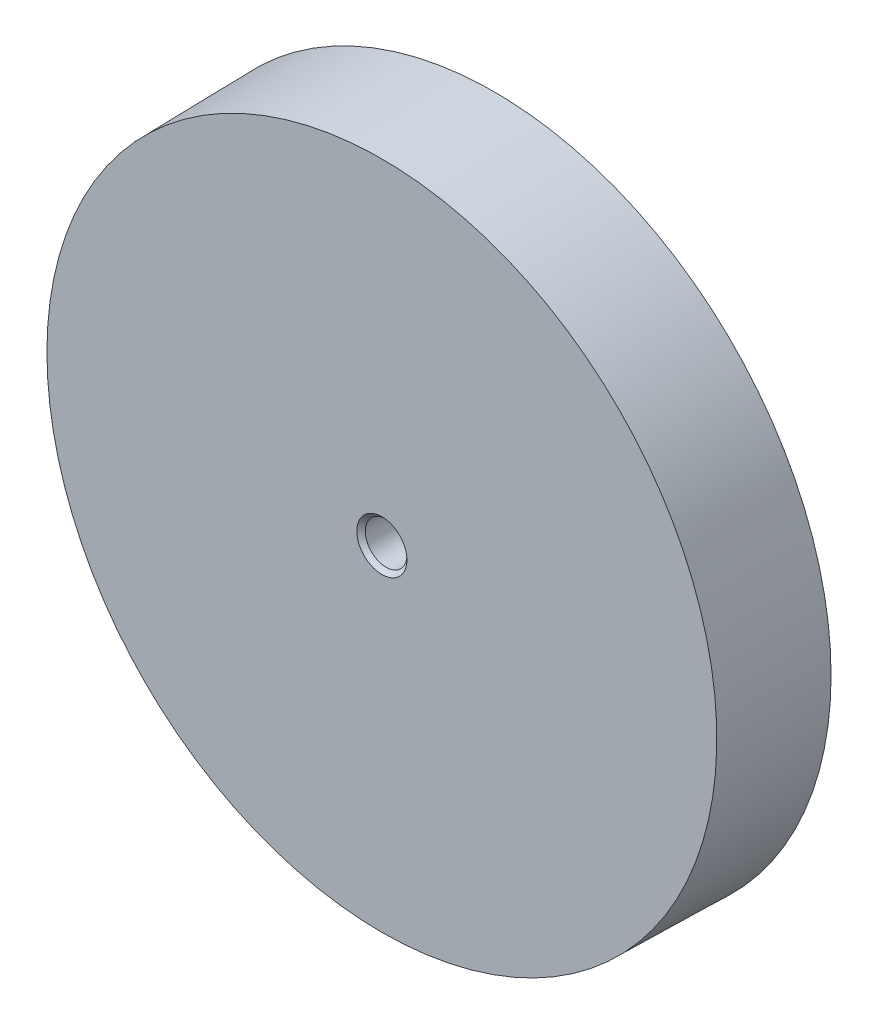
ISO-10303-21;
HEADER;
FILE_DESCRIPTION(('STEP AP214'),'2;1');
FILE_NAME('part.step','',(''),(''),'','','');
FILE_SCHEMA(('AUTOMOTIVE_DESIGN { 1 0 10303 214 1 1 1 1 }'));
ENDSEC;
DATA;
#1=APPLICATION_CONTEXT('core data for automotive mechanical design processes');
#2=APPLICATION_PROTOCOL_DEFINITION('international standard','automotive_design',2000,#1);
#3=PRODUCT_CONTEXT('',#1,'mechanical');
#4=PRODUCT('Part','Part','',(#3));
#5=PRODUCT_RELATED_PRODUCT_CATEGORY('part','',(#4));
#6=PRODUCT_DEFINITION_FORMATION('','',#4);
#7=PRODUCT_DEFINITION_CONTEXT('part definition',#1,'design');
#8=PRODUCT_DEFINITION('design','',#6,#7);
#9=PRODUCT_DEFINITION_SHAPE('','',#8);
#10=(LENGTH_UNIT() NAMED_UNIT(*) SI_UNIT(.MILLI.,.METRE.));
#11=(NAMED_UNIT(*) PLANE_ANGLE_UNIT() SI_UNIT($,.RADIAN.));
#12=(NAMED_UNIT(*) SI_UNIT($,.STERADIAN.) SOLID_ANGLE_UNIT());
#13=UNCERTAINTY_MEASURE_WITH_UNIT(LENGTH_MEASURE(1.E-05),#10,'distance_accuracy_value','');
#14=(GEOMETRIC_REPRESENTATION_CONTEXT(3) GLOBAL_UNCERTAINTY_ASSIGNED_CONTEXT((#13)) GLOBAL_UNIT_ASSIGNED_CONTEXT((#10,
#11,#12)) REPRESENTATION_CONTEXT('',''));
#15=CARTESIAN_POINT('',(0.,0.,0.));
#16=DIRECTION('',(0.,0.,1.));
#17=DIRECTION('',(1.,0.,0.));
#18=AXIS2_PLACEMENT_3D('',#15,#16,#17);
#19=CARTESIAN_POINT('',(35.1794439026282,-55.2744763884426,6.03));
#20=DIRECTION('',(0.,0.,-1.));
#21=DIRECTION('',(-1.,0.,0.));
#22=AXIS2_PLACEMENT_3D('',#19,#20,#21);
#23=PLANE('',#22);
#24=DIRECTION('',(0.866025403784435,0.500000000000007,0.));
#25=VECTOR('',#24,1.);
#26=CARTESIAN_POINT('',(35.6819439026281,-56.1448319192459,6.03));
#27=LINE('',#26,#25);
#28=CARTESIAN_POINT('',(38.601205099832,-54.4593956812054,6.03));
#29=VERTEX_POINT('',#28);
#30=CARTESIAN_POINT('',(48.6345453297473,-48.6666439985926,6.03));
#31=VERTEX_POINT('',#30);
#32=EDGE_CURVE('E1919',#29,#31,#27,.T.);
#33=ORIENTED_EDGE('',*,*,#32,.T.);
#34=CARTESIAN_POINT('',(49.1051323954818,-47.2344763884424,6.03));
#35=DIRECTION('',(0.,0.,-1.));
#36=DIRECTION('',(-1.,0.,0.));
#37=AXIS2_PLACEMENT_3D('',#34,#35,#36);
#38=CIRCLE('',#37,1.5075);
#39=CARTESIAN_POINT('',(50.5807194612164,-47.543019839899,6.03));
#40=VERTEX_POINT('',#39);
#41=EDGE_CURVE('E329',#31,#40,#38,.F.);
#42=ORIENTED_EDGE('',*,*,#41,.T.);
#43=CARTESIAN_POINT('',(54.8099745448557,-45.1012582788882,6.03));
#44=VERTEX_POINT('',#43);
#45=EDGE_CURVE('E337',#40,#44,#27,.T.);
#46=ORIENTED_EDGE('',*,*,#45,.T.);
#47=CARTESIAN_POINT('',(35.1794439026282,-55.2744763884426,6.03));
#48=DIRECTION('',(0.,0.,-1.));
#49=DIRECTION('',(-1.,0.,0.));
#50=AXIS2_PLACEMENT_3D('',#47,#48,#49);
#51=CIRCLE('',#50,22.11);
#52=CARTESIAN_POINT('',(54.7168941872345,-65.6253283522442,6.03));
#53=VERTEX_POINT('',#52);
#54=EDGE_CURVE('E790',#44,#53,#51,.T.);
#55=ORIENTED_EDGE('',*,*,#54,.T.);
#56=DIRECTION('',(-0.860907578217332,0.508761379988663,0.));
#57=VECTOR('',#56,1.);
#58=CARTESIAN_POINT('',(35.7028440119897,-54.3887976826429,6.03));
#59=LINE('',#58,#57);
#60=CARTESIAN_POINT('',(50.6080617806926,-63.1971754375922,6.03));
#61=VERTEX_POINT('',#60);
#62=EDGE_CURVE('E971',#53,#61,#59,.T.);
#63=ORIENTED_EDGE('',*,*,#62,.T.);
#64=CARTESIAN_POINT('',(49.105132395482,-63.3144763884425,6.03));
#65=DIRECTION('',(0.,0.,-1.));
#66=DIRECTION('',(-1.,0.,0.));
#67=AXIS2_PLACEMENT_3D('',#64,#65,#66);
#68=CIRCLE('',#67,1.5075);
#69=CARTESIAN_POINT('',(48.4829887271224,-61.9413436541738,6.03));
#70=VERTEX_POINT('',#69);
#71=EDGE_CURVE('E1988',#61,#70,#68,.F.);
#72=ORIENTED_EDGE('',*,*,#71,.T.);
#73=CARTESIAN_POINT('',(38.5986729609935,-56.1001148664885,6.03));
#74=VERTEX_POINT('',#73);
#75=EDGE_CURVE('E961',#70,#74,#59,.T.);
#76=ORIENTED_EDGE('',*,*,#75,.T.);
#77=CARTESIAN_POINT('',(35.1794439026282,-55.2744763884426,6.03));
#78=DIRECTION('',(0.,0.,-1.));
#79=DIRECTION('',(-1.,0.,0.));
#80=AXIS2_PLACEMENT_3D('',#77,#78,#79);
#81=CIRCLE('',#80,3.5175);
#82=EDGE_CURVE('E894',#29,#74,#81,.T.);
#83=ORIENTED_EDGE('',*,*,#82,.F.);
#84=EDGE_LOOP('',(#33,#42,#46,#55,#63,#72,#76,#83));
#85=FACE_BOUND('',#84,.T.);
#86=ADVANCED_FACE('F16',(#85),#23,.T.);
#87=DIRECTION('',(-0.871054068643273,-0.491187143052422,0.));
#88=VECTOR('',#87,1.);
#89=CARTESIAN_POINT('',(34.6741236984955,-54.378359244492,6.03));
#90=LINE('',#89,#88);
#91=CARTESIAN_POINT('',(53.9122697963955,-43.5299740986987,6.03));
#92=VERTEX_POINT('',#91);
#93=CARTESIAN_POINT('',(49.7550114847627,-45.8742508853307,6.03));
#94=VERTEX_POINT('',#93);
#95=EDGE_CURVE('E440',#92,#94,#90,.T.);
#96=ORIENTED_EDGE('',*,*,#95,.T.);
#97=CARTESIAN_POINT('',(49.1051323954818,-47.2344763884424,6.03));
#98=DIRECTION('',(0.,0.,-1.));
#99=DIRECTION('',(-1.,0.,0.));
#100=AXIS2_PLACEMENT_3D('',#97,#98,#99);
#101=CIRCLE('',#100,1.5075);
#102=CARTESIAN_POINT('',(47.6048927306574,-47.0867022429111,6.03));
#103=VERTEX_POINT('',#102);
#104=EDGE_CURVE('E1903',#94,#103,#101,.F.);
#105=ORIENTED_EDGE('',*,*,#104,.T.);
#106=CARTESIAN_POINT('',(37.6040823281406,-52.7261564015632,6.03));
#107=VERTEX_POINT('',#106);
#108=EDGE_CURVE('E431',#103,#107,#90,.T.);
#109=ORIENTED_EDGE('',*,*,#108,.T.);
#110=CARTESIAN_POINT('',(36.1844439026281,-51.9036039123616,6.03));
#111=VERTEX_POINT('',#110);
#112=EDGE_CURVE('E882',#111,#107,#81,.T.);
#113=ORIENTED_EDGE('',*,*,#112,.F.);
#114=DIRECTION('',(0.,1.,0.));
#115=VECTOR('',#114,1.);
#116=CARTESIAN_POINT('',(36.1844439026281,-55.2744763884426,6.03));
#117=LINE('',#116,#115);
#118=CARTESIAN_POINT('',(36.1844439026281,-40.3181005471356,6.03));
#119=VERTEX_POINT('',#118);
#120=EDGE_CURVE('E397',#111,#119,#117,.T.);
#121=ORIENTED_EDGE('',*,*,#120,.T.);
#122=CARTESIAN_POINT('',(35.1794439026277,-39.1944763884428,6.03));
#123=DIRECTION('',(0.,0.,-1.));
#124=DIRECTION('',(-1.,0.,0.));
#125=AXIS2_PLACEMENT_3D('',#122,#123,#124);
#126=CIRCLE('',#125,1.50749999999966);
#127=CARTESIAN_POINT('',(36.1844439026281,-38.07085222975,6.03));
#128=VERTEX_POINT('',#127);
#129=EDGE_CURVE('E2037',#119,#128,#126,.F.);
#130=ORIENTED_EDGE('',*,*,#129,.T.);
#131=CARTESIAN_POINT('',(36.1844439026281,-33.1873291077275,6.03));
#132=VERTEX_POINT('',#131);
#133=EDGE_CURVE('E2043',#128,#132,#117,.T.);
#134=ORIENTED_EDGE('',*,*,#133,.T.);
#135=EDGE_CURVE('E775',#132,#92,#51,.T.);
#136=ORIENTED_EDGE('',*,*,#135,.T.);
#137=EDGE_LOOP('',(#96,#105,#109,#113,#121,#130,#134,#136));
#138=FACE_BOUND('',#137,.T.);
#139=ADVANCED_FACE('F996',(#138),#23,.T.);
#140=CARTESIAN_POINT('',(34.6741236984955,-54.378359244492,6.03));
#141=DIRECTION('',(-0.490513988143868,0.86986031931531,-0.0523359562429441));
#142=DIRECTION('',(0.871054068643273,0.491187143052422,0.));
#143=AXIS2_PLACEMENT_3D('',#140,#141,#142);
#144=PLANE('',#143);
#145=CARTESIAN_POINT('',(49.1051323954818,-47.2344763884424,-10.4869697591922));
#146=DIRECTION('',(-0.490513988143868,0.86986031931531,-0.0523359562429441));
#147=DIRECTION('',(-0.0257067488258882,0.0455874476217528,0.998629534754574));
#148=AXIS2_PLACEMENT_3D('',#145,#146,#147);
#149=ELLIPSE('',#148,28.8042888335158,1.5075);
#150=CARTESIAN_POINT('',(50.0579135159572,-46.0662450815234,0.));
#151=VERTEX_POINT('',#150);
#152=EDGE_CURVE('E1899',#94,#151,#149,.T.);
#153=ORIENTED_EDGE('',*,*,#152,.F.);
#154=ORIENTED_EDGE('',*,*,#95,.F.);
#155=CARTESIAN_POINT('',(53.9122697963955,-43.5299740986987,6.03));
#156=CARTESIAN_POINT('',(53.9862013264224,-43.5487495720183,5.02502191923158));
#157=CARTESIAN_POINT('',(54.0599574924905,-43.5676245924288,4.02003287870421));
#158=CARTESIAN_POINT('',(54.2071190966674,-43.6055737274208,2.0100328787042));
#159=CARTESIAN_POINT('',(54.2805245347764,-43.6246478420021,1.00502191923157));
#160=CARTESIAN_POINT('',(54.3537546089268,-43.6438215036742,0.));
#161=B_SPLINE_CURVE_WITH_KNOTS('',3,(#155,#156,#157,#158,#159,#160),.UNSPECIFIED.,.F.,.F.,(4,2,
4),(0.,3.0236059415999,6.04721188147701),.UNSPECIFIED.);
#162=CARTESIAN_POINT('',(54.3537546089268,-43.6438215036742,0.));
#163=VERTEX_POINT('',#162);
#164=EDGE_CURVE('E433',#92,#163,#161,.T.);
#165=ORIENTED_EDGE('',*,*,#164,.T.);
#166=DIRECTION('',(-0.871054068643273,-0.491187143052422,0.));
#167=VECTOR('',#166,1.);
#168=CARTESIAN_POINT('',(34.8293481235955,-54.6536288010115,0.));
#169=LINE('',#168,#167);
#170=EDGE_CURVE('E396',#151,#163,#169,.F.);
#171=ORIENTED_EDGE('',*,*,#170,.F.);
#172=EDGE_LOOP('',(#153,#154,#165,#171));
#173=FACE_BOUND('',#172,.T.);
#174=ADVANCED_FACE('F420',(#173),#144,.T.);
#175=CARTESIAN_POINT('',(47.6124395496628,-47.4452471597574,0.));
#176=VERTEX_POINT('',#175);
#177=EDGE_CURVE('E1905',#176,#103,#149,.T.);
#178=ORIENTED_EDGE('',*,*,#177,.F.);
#179=CARTESIAN_POINT('',(37.5480224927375,-53.1205690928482,0.));
#180=VERTEX_POINT('',#179);
#181=EDGE_CURVE('E362',#180,#176,#169,.F.);
#182=ORIENTED_EDGE('',*,*,#181,.F.);
#183=CARTESIAN_POINT('',(37.6040823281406,-52.7261564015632,6.03));
#184=CARTESIAN_POINT('',(37.6000450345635,-52.7586681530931,5.52747104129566));
#185=CARTESIAN_POINT('',(37.595860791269,-52.7912623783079,5.02494858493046));
#186=CARTESIAN_POINT('',(37.5871812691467,-52.8566253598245,4.01991799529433));
#187=CARTESIAN_POINT('',(37.582685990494,-52.889394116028,3.51740986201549));
#188=CARTESIAN_POINT('',(37.5733672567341,-52.9551157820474,2.51240863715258));
#189=CARTESIAN_POINT('',(37.5685438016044,-52.9880686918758,2.00991554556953));
#190=CARTESIAN_POINT('',(37.5585489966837,-53.0541697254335,1.00494538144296));
#191=CARTESIAN_POINT('',(37.553377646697,-53.0873178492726,0.502468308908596));
#192=CARTESIAN_POINT('',(37.5480224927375,-53.1205690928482,0.));
#193=B_SPLINE_CURVE_WITH_KNOTS('',3,(#183,#184,#185,#186,#187,#188,#189,#190,#191,#192),
.UNSPECIFIED.,.F.,.F.,(4,2,2,2,4),(0.,1.51078720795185,3.02157356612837,4.5323600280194,
6.04314733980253),.UNSPECIFIED.);
#194=EDGE_CURVE('E424',#107,#180,#193,.T.);
#195=ORIENTED_EDGE('',*,*,#194,.F.);
#196=ORIENTED_EDGE('',*,*,#108,.F.);
#197=EDGE_LOOP('',(#178,#182,#195,#196));
#198=FACE_BOUND('',#197,.T.);
#199=ADVANCED_FACE('F1693',(#198),#144,.T.);
#200=CARTESIAN_POINT('',(35.6819439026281,-56.1448319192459,6.03));
#201=DIRECTION('',(0.499314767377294,-0.864838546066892,-0.0523359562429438));
#202=DIRECTION('',(-0.866025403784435,-0.500000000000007,0.));
#203=AXIS2_PLACEMENT_3D('',#200,#201,#202);
#204=PLANE('',#203);
#205=CARTESIAN_POINT('',(49.1051323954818,-47.2344763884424,-13.1465423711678));
#206=DIRECTION('',(0.499314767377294,-0.864838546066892,-0.0523359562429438));
#207=DIRECTION('',(0.0261679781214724,-0.0453242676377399,0.998629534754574));
#208=AXIS2_PLACEMENT_3D('',#205,#206,#207);
#209=ELLIPSE('',#208,28.8042888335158,1.5075);
#210=CARTESIAN_POINT('',(48.288418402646,-48.5015732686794,0.));
#211=VERTEX_POINT('',#210);
#212=EDGE_CURVE('E326',#31,#211,#209,.T.);
#213=ORIENTED_EDGE('',*,*,#212,.F.);
#214=ORIENTED_EDGE('',*,*,#32,.F.);
#215=CARTESIAN_POINT('',(38.2315329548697,-54.3079187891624,0.));
#216=CARTESIAN_POINT('',(38.2630260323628,-54.3201432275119,0.502467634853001));
#217=CARTESIAN_POINT('',(38.2943342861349,-54.3324749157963,1.00494422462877));
#218=CARTESIAN_POINT('',(38.3566010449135,-54.3573412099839,2.00991376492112));
#219=CARTESIAN_POINT('',(38.3875595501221,-54.36987581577,2.51240671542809));
#220=CARTESIAN_POINT('',(38.449146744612,-54.3951363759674,3.51740797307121));
#221=CARTESIAN_POINT('',(38.4797754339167,-54.4078623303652,4.01991628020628));
#222=CARTESIAN_POINT('',(38.540720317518,-54.4334955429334,5.02494751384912));
#223=CARTESIAN_POINT('',(38.5710365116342,-54.4464028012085,5.52747044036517));
#224=CARTESIAN_POINT('',(38.601205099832,-54.4593956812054,6.03));
#225=B_SPLINE_CURVE_WITH_KNOTS('',3,(#215,#216,#217,#218,#219,#220,#221,#222,#223,#224),
.UNSPECIFIED.,.F.,.F.,(4,2,2,2,4),(0.,1.51080592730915,3.02161098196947,4.53241593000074,
6.04322175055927),.UNSPECIFIED.);
#226=CARTESIAN_POINT('',(38.2315329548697,-54.3079187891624,0.));
#227=VERTEX_POINT('',#226);
#228=EDGE_CURVE('E346',#227,#29,#225,.T.);
#229=ORIENTED_EDGE('',*,*,#228,.F.);
#230=DIRECTION('',(0.866025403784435,0.500000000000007,0.));
#231=VECTOR('',#230,1.);
#232=CARTESIAN_POINT('',(35.5239344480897,-55.8711515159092,0.));
#233=LINE('',#232,#231);
#234=EDGE_CURVE('E347',#211,#227,#233,.F.);
#235=ORIENTED_EDGE('',*,*,#234,.F.);
#236=EDGE_LOOP('',(#213,#214,#229,#235));
#237=FACE_BOUND('',#236,.T.);
#238=ADVANCED_FACE('F1687',(#237),#204,.T.);
#239=CARTESIAN_POINT('',(50.6108274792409,-47.1607297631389,0.));
#240=VERTEX_POINT('',#239);
#241=EDGE_CURVE('E323',#240,#40,#209,.T.);
#242=ORIENTED_EDGE('',*,*,#241,.F.);
#243=CARTESIAN_POINT('',(54.9362687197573,-44.6634350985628,0.));
#244=VERTEX_POINT('',#243);
#245=EDGE_CURVE('E335',#244,#240,#233,.F.);
#246=ORIENTED_EDGE('',*,*,#245,.F.);
#247=CARTESIAN_POINT('',(54.9362687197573,-44.6634350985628,0.));
#248=CARTESIAN_POINT('',(54.9155687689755,-44.7362054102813,1.00502184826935));
#249=CARTESIAN_POINT('',(54.8946942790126,-44.8090758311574,2.0100327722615));
#250=CARTESIAN_POINT('',(54.8525962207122,-44.9550168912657,4.02003277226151));
#251=CARTESIAN_POINT('',(54.8313726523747,-45.0280875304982,5.02502184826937));
#252=CARTESIAN_POINT('',(54.8099745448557,-45.1012582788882,6.03));
#253=B_SPLINE_CURVE_WITH_KNOTS('',3,(#247,#248,#249,#250,#251,#252),.UNSPECIFIED.,.F.,.F.,(4,2,
4),(0.,3.02359640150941,6.04719280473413),.UNSPECIFIED.);
#254=EDGE_CURVE('E432',#244,#44,#253,.T.);
#255=ORIENTED_EDGE('',*,*,#254,.T.);
#256=ORIENTED_EDGE('',*,*,#45,.F.);
#257=EDGE_LOOP('',(#242,#246,#255,#256));
#258=FACE_BOUND('',#257,.T.);
#259=ADVANCED_FACE('F333',(#258),#204,.T.);
#260=DIRECTION('',(0.86602540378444,-0.5,0.));
#261=VECTOR('',#260,1.);
#262=CARTESIAN_POINT('',(34.6769439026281,-56.1448319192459,6.03));
#263=LINE('',#262,#261);
#264=CARTESIAN_POINT('',(37.596205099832,-57.8302681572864,6.03));
#265=VERTEX_POINT('',#264);
#266=CARTESIAN_POINT('',(47.6295453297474,-63.6230198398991,6.03));
#267=VERTEX_POINT('',#266);
#268=EDGE_CURVE('E682',#265,#267,#263,.T.);
#269=ORIENTED_EDGE('',*,*,#268,.T.);
#270=CARTESIAN_POINT('',(49.105132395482,-63.3144763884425,6.03));
#271=DIRECTION('',(0.,0.,-1.));
#272=DIRECTION('',(-1.,0.,0.));
#273=AXIS2_PLACEMENT_3D('',#270,#271,#272);
#274=CIRCLE('',#273,1.5075);
#275=CARTESIAN_POINT('',(49.5757194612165,-64.7466439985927,6.03));
#276=VERTEX_POINT('',#275);
#277=EDGE_CURVE('E1942',#267,#276,#274,.F.);
#278=ORIENTED_EDGE('',*,*,#277,.T.);
#279=CARTESIAN_POINT('',(53.8049745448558,-67.1884055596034,6.03));
#280=VERTEX_POINT('',#279);
#281=EDGE_CURVE('E672',#276,#280,#263,.T.);
#282=ORIENTED_EDGE('',*,*,#281,.T.);
#283=CARTESIAN_POINT('',(35.984068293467,-77.369830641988,6.03));
#284=VERTEX_POINT('',#283);
#285=EDGE_CURVE('E807',#280,#284,#51,.T.);
#286=ORIENTED_EDGE('',*,*,#285,.T.);
#287=DIRECTION('',(0.0101464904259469,0.999948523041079,0.));
#288=VECTOR('',#287,1.);
#289=CARTESIAN_POINT('',(36.2081642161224,-55.2849148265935,6.03));
#290=LINE('',#289,#288);
#291=CARTESIAN_POINT('',(36.032494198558,-72.597400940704,6.03));
#292=VERTEX_POINT('',#291);
#293=EDGE_CURVE('E643',#284,#292,#290,.T.);
#294=ORIENTED_EDGE('',*,*,#293,.T.);
#295=CARTESIAN_POINT('',(35.1794439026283,-71.3544763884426,6.03));
#296=DIRECTION('',(0.,0.,-1.));
#297=DIRECTION('',(-1.,0.,0.));
#298=AXIS2_PLACEMENT_3D('',#295,#296,#297);
#299=CIRCLE('',#298,1.5075);
#300=CARTESIAN_POINT('',(36.0575398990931,-70.1291177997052,6.03));
#301=VERTEX_POINT('',#300);
#302=EDGE_CURVE('E1952',#292,#301,#299,.F.);
#303=ORIENTED_EDGE('',*,*,#302,.T.);
#304=CARTESIAN_POINT('',(36.1740345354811,-58.6484348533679,6.03));
#305=VERTEX_POINT('',#304);
#306=EDGE_CURVE('E1045',#301,#305,#290,.T.);
#307=ORIENTED_EDGE('',*,*,#306,.T.);
#308=EDGE_CURVE('E912',#265,#305,#81,.T.);
#309=ORIENTED_EDGE('',*,*,#308,.F.);
#310=EDGE_LOOP('',(#269,#278,#282,#286,#294,#303,#307,#309));
#311=FACE_BOUND('',#310,.T.);
#312=ADVANCED_FACE('F986',(#311),#23,.T.);
#313=CARTESIAN_POINT('',(35.7028440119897,-54.3887976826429,6.03));
#314=DIRECTION('',(0.508064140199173,0.859727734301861,-0.0523359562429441));
#315=DIRECTION('',(0.860907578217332,-0.508761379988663,0.));
#316=AXIS2_PLACEMENT_3D('',#313,#314,#315);
#317=PLANE('',#316);
#318=CARTESIAN_POINT('',(49.105132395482,-63.3144763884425,-10.4869697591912));
#319=DIRECTION('',(0.508064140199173,0.859727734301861,-0.0523359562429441));
#320=DIRECTION('',(0.0266265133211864,0.0450564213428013,0.998629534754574));
#321=AXIS2_PLACEMENT_3D('',#318,#319,#320);
#322=ELLIPSE('',#321,28.8042888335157,1.5075);
#323=CARTESIAN_POINT('',(50.5932409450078,-63.5554933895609,0.));
#324=VERTEX_POINT('',#323);
#325=EDGE_CURVE('E1990',#61,#324,#322,.T.);
#326=ORIENTED_EDGE('',*,*,#325,.F.);
#327=ORIENTED_EDGE('',*,*,#62,.F.);
#328=CARTESIAN_POINT('',(54.7168941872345,-65.6253283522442,6.03));
#329=CARTESIAN_POINT('',(54.737599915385,-65.698742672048,5.02502191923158));
#330=CARTESIAN_POINT('',(54.7581317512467,-65.772054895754,4.02003287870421));
#331=CARTESIAN_POINT('',(54.7988476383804,-65.9184751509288,2.0100328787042));
#332=CARTESIAN_POINT('',(54.8190316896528,-65.9915831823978,1.00502191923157));
#333=CARTESIAN_POINT('',(54.8390418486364,-66.0645891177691,0.));
#334=B_SPLINE_CURVE_WITH_KNOTS('',3,(#328,#329,#330,#331,#332,#333),.UNSPECIFIED.,.F.,.F.,(4,2,
4),(0.,3.0236059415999,6.04721188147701),.UNSPECIFIED.);
#335=CARTESIAN_POINT('',(54.8390418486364,-66.0645891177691,0.));
#336=VERTEX_POINT('',#335);
#337=EDGE_CURVE('E365',#53,#336,#334,.T.);
#338=ORIENTED_EDGE('',*,*,#337,.T.);
#339=DIRECTION('',(-0.860907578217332,0.508761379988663,0.));
#340=VECTOR('',#339,1.);
#341=CARTESIAN_POINT('',(35.5420657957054,-54.660860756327,0.));
#342=LINE('',#341,#340);
#343=EDGE_CURVE('E382',#324,#336,#342,.F.);
#344=ORIENTED_EDGE('',*,*,#343,.F.);
#345=EDGE_LOOP('',(#326,#327,#338,#344));
#346=FACE_BOUND('',#345,.T.);
#347=ADVANCED_FACE('F983',(#346),#317,.T.);
#348=CARTESIAN_POINT('',(48.1762531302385,-62.1271518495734,0.));
#349=VERTEX_POINT('',#348);
#350=EDGE_CURVE('E1978',#349,#70,#322,.T.);
#351=ORIENTED_EDGE('',*,*,#350,.F.);
#352=CARTESIAN_POINT('',(38.2290716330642,-56.2487719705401,0.));
#353=VERTEX_POINT('',#352);
#354=EDGE_CURVE('E377',#353,#349,#342,.F.);
#355=ORIENTED_EDGE('',*,*,#354,.F.);
#356=CARTESIAN_POINT('',(38.5986729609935,-56.1001148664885,6.03));
#357=CARTESIAN_POINT('',(38.5684983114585,-56.1128743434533,5.52747104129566));
#358=CARTESIAN_POINT('',(38.5381787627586,-56.125547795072,5.02494858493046));
#359=CARTESIAN_POINT('',(38.4772329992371,-56.1507125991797,4.01991799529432));
#360=CARTESIAN_POINT('',(38.446606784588,-56.1632039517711,3.51740986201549));
#361=CARTESIAN_POINT('',(38.3850307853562,-56.1879945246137,2.51240863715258));
#362=CARTESIAN_POINT('',(38.3540810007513,-56.2002937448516,2.00991554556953));
#363=CARTESIAN_POINT('',(38.2918384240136,-56.2246885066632,1.00494538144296));
#364=CARTESIAN_POINT('',(38.2605456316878,-56.2367840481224,0.502468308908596));
#365=CARTESIAN_POINT('',(38.2290716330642,-56.2487719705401,0.));
#366=B_SPLINE_CURVE_WITH_KNOTS('',3,(#356,#357,#358,#359,#360,#361,#362,#363,#364,#365),
.UNSPECIFIED.,.F.,.F.,(4,2,2,2,4),(0.,1.51078720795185,3.02157356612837,4.5323600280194,
6.04314733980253),.UNSPECIFIED.);
#367=EDGE_CURVE('E681',#74,#353,#366,.T.);
#368=ORIENTED_EDGE('',*,*,#367,.F.);
#369=ORIENTED_EDGE('',*,*,#75,.F.);
#370=EDGE_LOOP('',(#351,#355,#368,#369));
#371=FACE_BOUND('',#370,.T.);
#372=ADVANCED_FACE('F960',(#371),#317,.T.);
#373=CARTESIAN_POINT('',(34.6769439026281,-56.1448319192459,6.03));
#374=DIRECTION('',(-0.499314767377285,-0.864838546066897,-0.0523359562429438));
#375=DIRECTION('',(-0.86602540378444,0.5,0.));
#376=AXIS2_PLACEMENT_3D('',#373,#374,#375);
#377=PLANE('',#376);
#378=CARTESIAN_POINT('',(49.105132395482,-63.3144763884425,-13.1465423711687));
#379=DIRECTION('',(-0.499314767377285,-0.864838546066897,-0.0523359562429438));
#380=DIRECTION('',(-0.0261679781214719,-0.0453242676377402,0.998629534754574));
#381=AXIS2_PLACEMENT_3D('',#378,#379,#380);
#382=ELLIPSE('',#381,28.8042888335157,1.5075);
#383=CARTESIAN_POINT('',(47.5994373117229,-63.240729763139,0.));
#384=VERTEX_POINT('',#383);
#385=EDGE_CURVE('E339',#267,#384,#382,.T.);
#386=ORIENTED_EDGE('',*,*,#385,.F.);
#387=ORIENTED_EDGE('',*,*,#268,.F.);
#388=CARTESIAN_POINT('',(37.5425518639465,-57.4343842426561,0.));
#389=CARTESIAN_POINT('',(37.5477117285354,-57.4677702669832,0.502467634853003));
#390=CARTESIAN_POINT('',(37.5526863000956,-57.5010498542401,1.00494422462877));
#391=CARTESIAN_POINT('',(37.5622848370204,-57.5674075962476,2.00991376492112));
#392=CARTESIAN_POINT('',(37.5669088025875,-57.6004857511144,2.51240671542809));
#393=CARTESIAN_POINT('',(37.5758261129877,-57.6664521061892,3.51740797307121));
#394=CARTESIAN_POINT('',(37.5801194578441,-57.6993403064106,4.01991628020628));
#395=CARTESIAN_POINT('',(37.5883928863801,-57.7649367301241,5.02494751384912));
#396=CARTESIAN_POINT('',(37.5923729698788,-57.7976449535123,5.52747044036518));
#397=CARTESIAN_POINT('',(37.596205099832,-57.8302681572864,6.03));
#398=B_SPLINE_CURVE_WITH_KNOTS('',3,(#388,#389,#390,#391,#392,#393,#394,#395,#396,#397),
.UNSPECIFIED.,.F.,.F.,(4,2,2,2,4),(0.,1.51080592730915,3.02161098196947,4.53241593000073,
6.04322175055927),.UNSPECIFIED.);
#399=CARTESIAN_POINT('',(37.5425518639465,-57.4343842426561,0.));
#400=VERTEX_POINT('',#399);
#401=EDGE_CURVE('E665',#400,#265,#398,.T.);
#402=ORIENTED_EDGE('',*,*,#401,.F.);
#403=DIRECTION('',(0.86602540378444,-0.5,0.));
#404=VECTOR('',#403,1.);
#405=CARTESIAN_POINT('',(34.8349533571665,-55.8711515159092,0.));
#406=LINE('',#405,#404);
#407=EDGE_CURVE('E381',#384,#400,#406,.F.);
#408=ORIENTED_EDGE('',*,*,#407,.F.);
#409=EDGE_LOOP('',(#386,#387,#402,#408));
#410=FACE_BOUND('',#409,.T.);
#411=ADVANCED_FACE('F662',(#410),#377,.T.);
#412=CARTESIAN_POINT('',(49.9218463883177,-64.5815732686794,0.));
#413=VERTEX_POINT('',#412);
#414=EDGE_CURVE('E713',#413,#276,#382,.T.);
#415=ORIENTED_EDGE('',*,*,#414,.F.);
#416=CARTESIAN_POINT('',(54.2472876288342,-67.0788679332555,0.));
#417=VERTEX_POINT('',#416);
#418=EDGE_CURVE('E673',#417,#413,#406,.F.);
#419=ORIENTED_EDGE('',*,*,#418,.F.);
#420=CARTESIAN_POINT('',(54.2472876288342,-67.0788679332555,0.));
#421=CARTESIAN_POINT('',(54.1739167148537,-67.0973264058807,1.00502184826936));
#422=CARTESIAN_POINT('',(54.1003718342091,-67.1156837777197,2.0100327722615));
#423=CARTESIAN_POINT('',(53.9529341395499,-67.1521963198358,4.02003277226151));
#424=CARTESIAN_POINT('',(53.879041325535,-67.1703514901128,5.02502184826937));
#425=CARTESIAN_POINT('',(53.8049745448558,-67.1884055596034,6.03));
#426=B_SPLINE_CURVE_WITH_KNOTS('',3,(#420,#421,#422,#423,#424,#425),.UNSPECIFIED.,.F.,.F.,(4,2,
4),(0.,3.02359640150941,6.04719280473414),.UNSPECIFIED.);
#427=EDGE_CURVE('E674',#417,#280,#426,.T.);
#428=ORIENTED_EDGE('',*,*,#427,.T.);
#429=ORIENTED_EDGE('',*,*,#281,.F.);
#430=EDGE_LOOP('',(#415,#419,#428,#429));
#431=FACE_BOUND('',#430,.T.);
#432=ADVANCED_FACE('F1017',(#431),#377,.T.);
#433=DIRECTION('',(0.,-1.,0.));
#434=VECTOR('',#433,1.);
#435=CARTESIAN_POINT('',(34.1744439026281,-55.2744763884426,6.03));
#436=LINE('',#435,#434);
#437=CARTESIAN_POINT('',(34.1744439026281,-58.6453488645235,6.03));
#438=VERTEX_POINT('',#437);
#439=CARTESIAN_POINT('',(34.1744439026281,-70.230852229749,6.03));
#440=VERTEX_POINT('',#439);
#441=EDGE_CURVE('E620',#438,#440,#436,.T.);
#442=ORIENTED_EDGE('',*,*,#441,.T.);
#443=CARTESIAN_POINT('',(35.1794439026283,-71.3544763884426,6.03));
#444=DIRECTION('',(0.,0.,-1.));
#445=DIRECTION('',(-1.,0.,0.));
#446=AXIS2_PLACEMENT_3D('',#443,#444,#445);
#447=CIRCLE('',#446,1.5075);
#448=CARTESIAN_POINT('',(34.1744439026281,-72.4781005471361,6.03));
#449=VERTEX_POINT('',#448);
#450=EDGE_CURVE('E1025',#440,#449,#447,.F.);
#451=ORIENTED_EDGE('',*,*,#450,.T.);
#452=CARTESIAN_POINT('',(34.1744439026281,-77.3616236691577,6.03));
#453=VERTEX_POINT('',#452);
#454=EDGE_CURVE('E610',#449,#453,#436,.T.);
#455=ORIENTED_EDGE('',*,*,#454,.T.);
#456=CARTESIAN_POINT('',(16.4466180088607,-67.0189786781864,6.03));
#457=VERTEX_POINT('',#456);
#458=EDGE_CURVE('E793',#453,#457,#51,.T.);
#459=ORIENTED_EDGE('',*,*,#458,.T.);
#460=DIRECTION('',(0.871054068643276,0.491187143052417,0.));
#461=VECTOR('',#460,1.);
#462=CARTESIAN_POINT('',(35.6847641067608,-56.1705935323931,6.03));
#463=LINE('',#462,#461);
#464=CARTESIAN_POINT('',(20.6038763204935,-64.6747018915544,6.03));
#465=VERTEX_POINT('',#464);
#466=EDGE_CURVE('E579',#457,#465,#463,.T.);
#467=ORIENTED_EDGE('',*,*,#466,.T.);
#468=CARTESIAN_POINT('',(21.2537554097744,-63.3144763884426,6.03));
#469=DIRECTION('',(0.,0.,-1.));
#470=DIRECTION('',(-1.,0.,0.));
#471=AXIS2_PLACEMENT_3D('',#468,#469,#470);
#472=CIRCLE('',#471,1.5075);
#473=CARTESIAN_POINT('',(22.7539950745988,-63.4622505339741,6.03));
#474=VERTEX_POINT('',#473);
#475=EDGE_CURVE('E2014',#465,#474,#472,.F.);
#476=ORIENTED_EDGE('',*,*,#475,.T.);
#477=CARTESIAN_POINT('',(32.7548054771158,-57.8227963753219,6.03));
#478=VERTEX_POINT('',#477);
#479=EDGE_CURVE('E2504',#474,#478,#463,.T.);
#480=ORIENTED_EDGE('',*,*,#479,.T.);
#481=EDGE_CURVE('E897',#438,#478,#81,.T.);
#482=ORIENTED_EDGE('',*,*,#481,.F.);
#483=EDGE_LOOP('',(#442,#451,#455,#459,#467,#476,#480,#482));
#484=FACE_BOUND('',#483,.T.);
#485=ADVANCED_FACE('F655',(#484),#23,.T.);
#486=CARTESIAN_POINT('',(36.2081642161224,-55.2849148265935,6.03));
#487=DIRECTION('',(0.998578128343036,-0.0101325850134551,-0.052335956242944));
#488=DIRECTION('',(-0.0523386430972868,0.,-0.99862939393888));
#489=AXIS2_PLACEMENT_3D('',#486,#487,#488);
#490=PLANE('',#489);
#491=CARTESIAN_POINT('',(35.1794439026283,-71.3544763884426,-10.4869697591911));
#492=DIRECTION('',(0.998578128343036,-0.0101325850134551,-0.052335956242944));
#493=DIRECTION('',(0.0523332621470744,-0.000531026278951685,0.998629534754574));
#494=AXIS2_PLACEMENT_3D('',#491,#492,#493);
#495=ELLIPSE('',#494,28.8042888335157,1.5075);
#496=CARTESIAN_POINT('',(35.7147713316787,-72.76372469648,0.));
#497=VERTEX_POINT('',#496);
#498=EDGE_CURVE('E1950',#292,#497,#495,.T.);
#499=ORIENTED_EDGE('',*,*,#498,.F.);
#500=ORIENTED_EDGE('',*,*,#293,.F.);
#501=CARTESIAN_POINT('',(35.984068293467,-77.369830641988,6.03));
#502=CARTESIAN_POINT('',(35.9308424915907,-77.4244694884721,5.02502191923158));
#503=CARTESIAN_POINT('',(35.8776181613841,-77.4789066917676,4.02003287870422));
#504=CARTESIAN_POINT('',(35.771172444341,-77.5873778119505,2.01003287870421));
#505=CARTESIAN_POINT('',(35.7179510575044,-77.6414117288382,1.00502191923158));
#506=CARTESIAN_POINT('',(35.6647311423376,-77.6952440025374,0.));
#507=B_SPLINE_CURVE_WITH_KNOTS('',3,(#501,#502,#503,#504,#505,#506),.UNSPECIFIED.,.F.,.F.,(4,2,
4),(0.,3.0236059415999,6.04721188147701),.UNSPECIFIED.);
#508=CARTESIAN_POINT('',(35.6647311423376,-77.6952440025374,0.));
#509=VERTEX_POINT('',#508);
#510=EDGE_CURVE('E635',#284,#509,#507,.T.);
#511=ORIENTED_EDGE('',*,*,#510,.T.);
#512=DIRECTION('',(0.0101464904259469,0.999948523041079,0.));
#513=VECTOR('',#512,1.);
#514=CARTESIAN_POINT('',(35.892161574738,-55.2817083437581,0.));
#515=LINE('',#514,#513);
#516=EDGE_CURVE('E687',#497,#509,#515,.F.);
#517=ORIENTED_EDGE('',*,*,#516,.F.);
#518=EDGE_LOOP('',(#499,#500,#511,#517));
#519=FACE_BOUND('',#518,.T.);
#520=ADVANCED_FACE('F651',(#519),#490,.T.);
#521=CARTESIAN_POINT('',(35.7432574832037,-69.9563810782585,0.));
#522=VERTEX_POINT('',#521);
#523=EDGE_CURVE('E1955',#522,#301,#495,.T.);
#524=ORIENTED_EDGE('',*,*,#523,.F.);
#525=CARTESIAN_POINT('',(35.8604930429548,-58.4026792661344,0.));
#526=VERTEX_POINT('',#525);
#527=EDGE_CURVE('E683',#526,#522,#515,.F.);
#528=ORIENTED_EDGE('',*,*,#527,.F.);
#529=CARTESIAN_POINT('',(36.1740345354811,-58.6484348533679,6.03));
#530=CARTESIAN_POINT('',(36.1478971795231,-58.6286825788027,5.52747104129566));
#531=CARTESIAN_POINT('',(36.1217618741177,-58.6087618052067,5.02494858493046));
#532=CARTESIAN_POINT('',(36.0694956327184,-58.5685636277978,4.01991799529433));
#533=CARTESIAN_POINT('',(36.0433646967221,-58.5482862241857,3.51740986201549));
#534=CARTESIAN_POINT('',(35.9911074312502,-58.5073551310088,2.51240863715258));
#535=CARTESIAN_POINT('',(35.964981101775,-58.4867014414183,2.00991554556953));
#536=CARTESIAN_POINT('',(35.912733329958,-58.4449951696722,1.00494538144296));
#537=CARTESIAN_POINT('',(35.8866118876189,-58.4239425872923,0.502468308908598));
#538=CARTESIAN_POINT('',(35.8604930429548,-58.4026792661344,0.));
#539=B_SPLINE_CURVE_WITH_KNOTS('',3,(#529,#530,#531,#532,#533,#534,#535,#536,#537,#538),
.UNSPECIFIED.,.F.,.F.,(4,2,2,2,4),(0.,1.51078720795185,3.02157356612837,4.5323600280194,
6.04314733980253),.UNSPECIFIED.);
#540=EDGE_CURVE('E619',#305,#526,#539,.T.);
#541=ORIENTED_EDGE('',*,*,#540,.F.);
#542=ORIENTED_EDGE('',*,*,#306,.F.);
#543=EDGE_LOOP('',(#524,#528,#541,#542));
#544=FACE_BOUND('',#543,.T.);
#545=ADVANCED_FACE('F654',(#544),#490,.T.);
#546=CARTESIAN_POINT('',(34.1744439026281,-55.2744763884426,6.03));
#547=DIRECTION('',(-0.998629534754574,0.,-0.052335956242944));
#548=DIRECTION('',(-0.052335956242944,0.,0.998629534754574));
#549=AXIS2_PLACEMENT_3D('',#546,#547,#548);
#550=PLANE('',#549);
#551=CARTESIAN_POINT('',(35.1794439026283,-71.3544763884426,-13.1465423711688));
#552=DIRECTION('',(-0.998629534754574,0.,-0.052335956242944));
#553=DIRECTION('',(-0.052335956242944,0.,0.998629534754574));
#554=AXIS2_PLACEMENT_3D('',#551,#552,#553);
#555=ELLIPSE('',#554,28.8042888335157,1.5075);
#556=CARTESIAN_POINT('',(34.4904628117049,-70.0136328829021,0.));
#557=VERTEX_POINT('',#556);
#558=EDGE_CURVE('E712',#440,#557,#555,.T.);
#559=ORIENTED_EDGE('',*,*,#558,.F.);
#560=ORIENTED_EDGE('',*,*,#441,.F.);
#561=CARTESIAN_POINT('',(34.4904628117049,-58.4009418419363,0.));
#562=CARTESIAN_POINT('',(34.4641295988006,-58.4221034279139,0.502467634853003));
#563=CARTESIAN_POINT('',(34.4377959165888,-58.4430513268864,1.00494422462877));
#564=CARTESIAN_POINT('',(34.3851276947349,-58.4845427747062,2.00991376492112));
#565=CARTESIAN_POINT('',(34.3587931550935,-58.505086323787,2.51240671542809));
#566=CARTESIAN_POINT('',(34.3061232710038,-58.5457921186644,3.51740797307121));
#567=CARTESIAN_POINT('',(34.2797879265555,-58.5659543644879,4.01991628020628));
#568=CARTESIAN_POINT('',(34.2271164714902,-58.6059175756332,5.02494751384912));
#569=CARTESIAN_POINT('',(34.2007803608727,-58.6257185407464,5.52747044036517));
#570=CARTESIAN_POINT('',(34.1744439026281,-58.6453488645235,6.03));
#571=B_SPLINE_CURVE_WITH_KNOTS('',3,(#561,#562,#563,#564,#565,#566,#567,#568,#569,#570),
.UNSPECIFIED.,.F.,.F.,(4,2,2,2,4),(0.,1.51080592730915,3.02161098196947,4.53241593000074,
6.04322175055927),.UNSPECIFIED.);
#572=CARTESIAN_POINT('',(34.4904628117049,-58.4009418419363,0.));
#573=VERTEX_POINT('',#572);
#574=EDGE_CURVE('E603',#573,#438,#571,.T.);
#575=ORIENTED_EDGE('',*,*,#574,.F.);
#576=DIRECTION('',(0.,-1.,0.));
#577=VECTOR('',#576,1.);
#578=CARTESIAN_POINT('',(34.4904628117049,-55.2744763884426,0.));
#579=LINE('',#578,#577);
#580=EDGE_CURVE('E632',#557,#573,#579,.F.);
#581=ORIENTED_EDGE('',*,*,#580,.F.);
#582=EDGE_LOOP('',(#559,#560,#575,#581));
#583=FACE_BOUND('',#582,.T.);
#584=ADVANCED_FACE('F599',(#583),#550,.T.);
#585=CARTESIAN_POINT('',(34.4904628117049,-72.6953198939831,0.));
#586=VERTEX_POINT('',#585);
#587=EDGE_CURVE('E709',#586,#449,#555,.T.);
#588=ORIENTED_EDGE('',*,*,#587,.F.);
#589=CARTESIAN_POINT('',(34.4904628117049,-77.6899092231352,0.));
#590=VERTEX_POINT('',#589);
#591=EDGE_CURVE('E611',#590,#586,#579,.F.);
#592=ORIENTED_EDGE('',*,*,#591,.F.);
#593=CARTESIAN_POINT('',(34.4904628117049,-77.6899092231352,0.));
#594=CARTESIAN_POINT('',(34.4377918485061,-77.6355973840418,1.00502184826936));
#595=CARTESIAN_POINT('',(34.3851214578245,-77.5810843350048,2.0100327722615));
#596=CARTESIAN_POINT('',(34.2797818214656,-77.4716558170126,4.02003277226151));
#597=CARTESIAN_POINT('',(34.2271125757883,-77.416740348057,5.02502184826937));
#598=CARTESIAN_POINT('',(34.1744439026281,-77.3616236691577,6.03));
#599=B_SPLINE_CURVE_WITH_KNOTS('',3,(#593,#594,#595,#596,#597,#598),.UNSPECIFIED.,.F.,.F.,(4,2,
4),(0.,3.02359640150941,6.04719280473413),.UNSPECIFIED.);
#600=EDGE_CURVE('E612',#590,#453,#599,.T.);
#601=ORIENTED_EDGE('',*,*,#600,.T.);
#602=ORIENTED_EDGE('',*,*,#454,.F.);
#603=EDGE_LOOP('',(#588,#592,#601,#602));
#604=FACE_BOUND('',#603,.T.);
#605=ADVANCED_FACE('F1010',(#604),#550,.T.);
#606=DIRECTION('',(-0.866025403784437,-0.5,0.));
#607=VECTOR('',#606,1.);
#608=CARTESIAN_POINT('',(34.6769439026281,-54.4041208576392,6.03));
#609=LINE('',#608,#607);
#610=CARTESIAN_POINT('',(31.7576827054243,-56.0895570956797,6.03));
#611=VERTEX_POINT('',#610);
#612=CARTESIAN_POINT('',(21.7243424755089,-61.8823087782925,6.03));
#613=VERTEX_POINT('',#612);
#614=EDGE_CURVE('E1046',#611,#613,#609,.T.);
#615=ORIENTED_EDGE('',*,*,#614,.T.);
#616=CARTESIAN_POINT('',(21.2537554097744,-63.3144763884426,6.03));
#617=DIRECTION('',(0.,0.,-1.));
#618=DIRECTION('',(-1.,0.,0.));
#619=AXIS2_PLACEMENT_3D('',#616,#617,#618);
#620=CIRCLE('',#619,1.5075);
#621=CARTESIAN_POINT('',(19.7781683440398,-63.0059329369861,6.03));
#622=VERTEX_POINT('',#621);
#623=EDGE_CURVE('E2009',#613,#622,#620,.F.);
#624=ORIENTED_EDGE('',*,*,#623,.T.);
#625=CARTESIAN_POINT('',(15.5489132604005,-65.4476944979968,6.03));
#626=VERTEX_POINT('',#625);
#627=EDGE_CURVE('E1048',#622,#626,#609,.T.);
#628=ORIENTED_EDGE('',*,*,#627,.T.);
#629=CARTESIAN_POINT('',(15.6419936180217,-44.9236244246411,6.03));
#630=VERTEX_POINT('',#629);
#631=EDGE_CURVE('E777',#626,#630,#51,.T.);
#632=ORIENTED_EDGE('',*,*,#631,.T.);
#633=DIRECTION('',(0.860907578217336,-0.508761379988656,0.));
#634=VECTOR('',#633,1.);
#635=CARTESIAN_POINT('',(34.6560437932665,-56.1601550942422,6.03));
#636=LINE('',#635,#634);
#637=CARTESIAN_POINT('',(19.7508260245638,-47.3517773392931,6.03));
#638=VERTEX_POINT('',#637);
#639=EDGE_CURVE('E527',#630,#638,#636,.T.);
#640=ORIENTED_EDGE('',*,*,#639,.T.);
#641=CARTESIAN_POINT('',(21.2537554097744,-47.2344763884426,6.03));
#642=DIRECTION('',(0.,0.,-1.));
#643=DIRECTION('',(-1.,0.,0.));
#644=AXIS2_PLACEMENT_3D('',#641,#642,#643);
#645=CIRCLE('',#644,1.5075);
#646=CARTESIAN_POINT('',(21.8758990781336,-48.6076091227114,6.03));
#647=VERTEX_POINT('',#646);
#648=EDGE_CURVE('E1083',#638,#647,#645,.F.);
#649=ORIENTED_EDGE('',*,*,#648,.T.);
#650=CARTESIAN_POINT('',(31.7602148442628,-54.4488379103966,6.03));
#651=VERTEX_POINT('',#650);
#652=EDGE_CURVE('E550',#647,#651,#636,.T.);
#653=ORIENTED_EDGE('',*,*,#652,.T.);
#654=EDGE_CURVE('E827',#611,#651,#81,.T.);
#655=ORIENTED_EDGE('',*,*,#654,.F.);
#656=EDGE_LOOP('',(#615,#624,#628,#632,#640,#649,#653,#655));
#657=FACE_BOUND('',#656,.T.);
#658=ADVANCED_FACE('F592',(#657),#23,.T.);
#659=CARTESIAN_POINT('',(35.6847641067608,-56.1705935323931,6.03));
#660=DIRECTION('',(0.490513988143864,-0.869860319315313,-0.0523359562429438));
#661=DIRECTION('',(-0.871054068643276,-0.491187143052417,0.));
#662=AXIS2_PLACEMENT_3D('',#659,#660,#661);
#663=PLANE('',#662);
#664=CARTESIAN_POINT('',(21.2537554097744,-63.3144763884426,-10.4869697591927));
#665=DIRECTION('',(0.490513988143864,-0.869860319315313,-0.0523359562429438));
#666=DIRECTION('',(0.0257067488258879,-0.0455874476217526,0.998629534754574));
#667=AXIS2_PLACEMENT_3D('',#664,#665,#666);
#668=ELLIPSE('',#667,28.8042888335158,1.5075);
#669=CARTESIAN_POINT('',(20.300974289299,-64.4827076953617,0.));
#670=VERTEX_POINT('',#669);
#671=EDGE_CURVE('E2015',#465,#670,#668,.T.);
#672=ORIENTED_EDGE('',*,*,#671,.F.);
#673=ORIENTED_EDGE('',*,*,#466,.F.);
#674=CARTESIAN_POINT('',(16.4466180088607,-67.0189786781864,6.03));
#675=CARTESIAN_POINT('',(16.3726864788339,-67.0002032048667,5.02502191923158));
#676=CARTESIAN_POINT('',(16.2989303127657,-66.9813281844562,4.02003287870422));
#677=CARTESIAN_POINT('',(16.1517687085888,-66.9433790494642,2.01003287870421));
#678=CARTESIAN_POINT('',(16.0783632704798,-66.9243049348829,1.00502191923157));
#679=CARTESIAN_POINT('',(16.0051331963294,-66.9051312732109,0.));
#680=B_SPLINE_CURVE_WITH_KNOTS('',3,(#674,#675,#676,#677,#678,#679),.UNSPECIFIED.,.F.,.F.,(4,2,
4),(0.,3.0236059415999,6.04721188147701),.UNSPECIFIED.);
#681=CARTESIAN_POINT('',(16.0051331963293,-66.9051312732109,0.));
#682=VERTEX_POINT('',#681);
#683=EDGE_CURVE('E571',#457,#682,#680,.T.);
#684=ORIENTED_EDGE('',*,*,#683,.T.);
#685=DIRECTION('',(0.871054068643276,0.491187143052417,0.));
#686=VECTOR('',#685,1.);
#687=CARTESIAN_POINT('',(35.5295396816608,-55.8953239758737,0.));
#688=LINE('',#687,#686);
#689=EDGE_CURVE('E625',#670,#682,#688,.F.);
#690=ORIENTED_EDGE('',*,*,#689,.F.);
#691=EDGE_LOOP('',(#672,#673,#684,#690));
#692=FACE_BOUND('',#691,.T.);
#693=ADVANCED_FACE('F588',(#692),#663,.T.);
#694=CARTESIAN_POINT('',(22.7464482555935,-63.1037056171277,0.));
#695=VERTEX_POINT('',#694);
#696=EDGE_CURVE('E2011',#695,#474,#668,.T.);
#697=ORIENTED_EDGE('',*,*,#696,.F.);
#698=CARTESIAN_POINT('',(32.8108653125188,-57.428383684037,0.));
#699=VERTEX_POINT('',#698);
#700=EDGE_CURVE('E621',#699,#695,#688,.F.);
#701=ORIENTED_EDGE('',*,*,#700,.F.);
#702=CARTESIAN_POINT('',(32.7548054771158,-57.8227963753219,6.03));
#703=CARTESIAN_POINT('',(32.7588427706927,-57.790284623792,5.52747104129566));
#704=CARTESIAN_POINT('',(32.7630270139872,-57.7576903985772,5.02494858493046));
#705=CARTESIAN_POINT('',(32.7717065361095,-57.6923274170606,4.01991799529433));
#706=CARTESIAN_POINT('',(32.7762018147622,-57.6595586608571,3.5174098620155));
#707=CARTESIAN_POINT('',(32.7855205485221,-57.5938369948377,2.51240863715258));
#708=CARTESIAN_POINT('',(32.7903440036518,-57.5608840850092,2.00991554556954));
#709=CARTESIAN_POINT('',(32.8003388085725,-57.4947830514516,1.00494538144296));
#710=CARTESIAN_POINT('',(32.8055101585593,-57.4616349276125,0.502468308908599));
#711=CARTESIAN_POINT('',(32.8108653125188,-57.428383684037,0.));
#712=B_SPLINE_CURVE_WITH_KNOTS('',3,(#702,#703,#704,#705,#706,#707,#708,#709,#710,#711),
.UNSPECIFIED.,.F.,.F.,(4,2,2,2,4),(0.,1.51078720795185,3.02157356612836,4.5323600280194,
6.04314733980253),.UNSPECIFIED.);
#713=EDGE_CURVE('E580',#478,#699,#712,.T.);
#714=ORIENTED_EDGE('',*,*,#713,.F.);
#715=ORIENTED_EDGE('',*,*,#479,.F.);
#716=EDGE_LOOP('',(#697,#701,#714,#715));
#717=FACE_BOUND('',#716,.T.);
#718=ADVANCED_FACE('F591',(#717),#663,.T.);
#719=CARTESIAN_POINT('',(34.6769439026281,-54.4041208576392,6.03));
#720=DIRECTION('',(-0.499314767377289,0.864838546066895,-0.0523359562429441));
#721=DIRECTION('',(0.866025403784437,0.5,0.));
#722=AXIS2_PLACEMENT_3D('',#719,#720,#721);
#723=PLANE('',#722);
#724=CARTESIAN_POINT('',(21.2537554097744,-63.3144763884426,-13.1465423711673));
#725=DIRECTION('',(-0.499314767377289,0.864838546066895,-0.0523359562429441));
#726=DIRECTION('',(-0.0261679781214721,0.0453242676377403,0.998629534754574));
#727=AXIS2_PLACEMENT_3D('',#724,#725,#726);
#728=ELLIPSE('',#727,28.8042888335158,1.5075);
#729=CARTESIAN_POINT('',(22.0704694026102,-62.0473795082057,0.));
#730=VERTEX_POINT('',#729);
#731=EDGE_CURVE('E708',#613,#730,#728,.T.);
#732=ORIENTED_EDGE('',*,*,#731,.F.);
#733=ORIENTED_EDGE('',*,*,#614,.F.);
#734=CARTESIAN_POINT('',(32.1273548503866,-56.2410339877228,0.));
#735=CARTESIAN_POINT('',(32.0958617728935,-56.2288095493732,0.502467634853));
#736=CARTESIAN_POINT('',(32.0645535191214,-56.2164778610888,1.00494422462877));
#737=CARTESIAN_POINT('',(32.0022867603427,-56.1916115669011,2.00991376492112));
#738=CARTESIAN_POINT('',(31.9713282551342,-56.1790769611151,2.51240671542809));
#739=CARTESIAN_POINT('',(31.9097410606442,-56.1538164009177,3.51740797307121));
#740=CARTESIAN_POINT('',(31.8791123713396,-56.1410904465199,4.01991628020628));
#741=CARTESIAN_POINT('',(31.8181674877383,-56.1154572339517,5.02494751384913));
#742=CARTESIAN_POINT('',(31.7878512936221,-56.1025499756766,5.52747044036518));
#743=CARTESIAN_POINT('',(31.7576827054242,-56.0895570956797,6.03));
#744=B_SPLINE_CURVE_WITH_KNOTS('',3,(#734,#735,#736,#737,#738,#739,#740,#741,#742,#743),
.UNSPECIFIED.,.F.,.F.,(4,2,2,2,4),(0.,1.51080592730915,3.02161098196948,4.53241593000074,
6.04322175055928),.UNSPECIFIED.);
#745=CARTESIAN_POINT('',(32.1273548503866,-56.2410339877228,0.));
#746=VERTEX_POINT('',#745);
#747=EDGE_CURVE('E528',#746,#611,#744,.T.);
#748=ORIENTED_EDGE('',*,*,#747,.F.);
#749=DIRECTION('',(-0.866025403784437,-0.5,0.));
#750=VECTOR('',#749,1.);
#751=CARTESIAN_POINT('',(34.8349533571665,-54.677801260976,0.));
#752=LINE('',#751,#750);
#753=EDGE_CURVE('E561',#730,#746,#752,.F.);
#754=ORIENTED_EDGE('',*,*,#753,.F.);
#755=EDGE_LOOP('',(#732,#733,#748,#754));
#756=FACE_BOUND('',#755,.T.);
#757=ADVANCED_FACE('F508',(#756),#723,.T.);
#758=CARTESIAN_POINT('',(19.7480603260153,-63.3882230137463,0.));
#759=VERTEX_POINT('',#758);
#760=EDGE_CURVE('E705',#759,#622,#728,.T.);
#761=ORIENTED_EDGE('',*,*,#760,.F.);
#762=CARTESIAN_POINT('',(15.4226190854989,-65.8855176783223,0.));
#763=VERTEX_POINT('',#762);
#764=EDGE_CURVE('E557',#763,#759,#752,.F.);
#765=ORIENTED_EDGE('',*,*,#764,.F.);
#766=CARTESIAN_POINT('',(15.4226190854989,-65.8855176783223,0.));
#767=CARTESIAN_POINT('',(15.4433190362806,-65.8127473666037,1.00502184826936));
#768=CARTESIAN_POINT('',(15.4641935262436,-65.7398769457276,2.0100327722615));
#769=CARTESIAN_POINT('',(15.506291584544,-65.5939358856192,4.02003277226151));
#770=CARTESIAN_POINT('',(15.5275151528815,-65.5208652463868,5.02502184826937));
#771=CARTESIAN_POINT('',(15.5489132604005,-65.4476944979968,6.03));
#772=B_SPLINE_CURVE_WITH_KNOTS('',3,(#766,#767,#768,#769,#770,#771),.UNSPECIFIED.,.F.,.F.,(4,2,
4),(0.,3.02359640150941,6.04719280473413),.UNSPECIFIED.);
#773=EDGE_CURVE('E513',#763,#626,#772,.T.);
#774=ORIENTED_EDGE('',*,*,#773,.T.);
#775=ORIENTED_EDGE('',*,*,#627,.F.);
#776=EDGE_LOOP('',(#761,#765,#774,#775));
#777=FACE_BOUND('',#776,.T.);
#778=ADVANCED_FACE('F1004',(#777),#723,.T.);
#779=DIRECTION('',(-0.866025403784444,0.499999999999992,0.));
#780=VECTOR('',#779,1.);
#781=CARTESIAN_POINT('',(35.6819439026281,-54.4041208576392,6.03));
#782=LINE('',#781,#780);
#783=CARTESIAN_POINT('',(32.7626827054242,-52.7186846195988,6.03));
#784=VERTEX_POINT('',#783);
#785=CARTESIAN_POINT('',(22.729342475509,-46.9259329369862,6.03));
#786=VERTEX_POINT('',#785);
#787=EDGE_CURVE('E853',#784,#786,#782,.T.);
#788=ORIENTED_EDGE('',*,*,#787,.T.);
#789=CARTESIAN_POINT('',(21.2537554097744,-47.2344763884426,6.03));
#790=DIRECTION('',(0.,0.,-1.));
#791=DIRECTION('',(-1.,0.,0.));
#792=AXIS2_PLACEMENT_3D('',#789,#790,#791);
#793=CIRCLE('',#792,1.5075);
#794=CARTESIAN_POINT('',(20.7831683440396,-45.8023087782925,6.03));
#795=VERTEX_POINT('',#794);
#796=EDGE_CURVE('E2023',#786,#795,#793,.F.);
#797=ORIENTED_EDGE('',*,*,#796,.T.);
#798=CARTESIAN_POINT('',(16.5539132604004,-43.3605472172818,6.03));
#799=VERTEX_POINT('',#798);
#800=EDGE_CURVE('E864',#795,#799,#782,.T.);
#801=ORIENTED_EDGE('',*,*,#800,.T.);
#802=CARTESIAN_POINT('',(34.1744439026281,-33.1873291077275,6.03));
#803=VERTEX_POINT('',#802);
#804=EDGE_CURVE('E763',#799,#803,#51,.T.);
#805=ORIENTED_EDGE('',*,*,#804,.T.);
#806=DIRECTION('',(0.,-1.,0.));
#807=VECTOR('',#806,1.);
#808=CARTESIAN_POINT('',(34.1744439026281,-55.2744763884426,6.03));
#809=LINE('',#808,#807);
#810=CARTESIAN_POINT('',(34.1744439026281,-38.0708522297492,6.03));
#811=VERTEX_POINT('',#810);
#812=EDGE_CURVE('E464',#803,#811,#809,.T.);
#813=ORIENTED_EDGE('',*,*,#812,.T.);
#814=CARTESIAN_POINT('',(35.1794439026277,-39.1944763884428,6.03));
#815=DIRECTION('',(0.,0.,-1.));
#816=DIRECTION('',(-1.,0.,0.));
#817=AXIS2_PLACEMENT_3D('',#814,#815,#816);
#818=CIRCLE('',#817,1.50749999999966);
#819=CARTESIAN_POINT('',(34.1744439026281,-40.3181005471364,6.03));
#820=VERTEX_POINT('',#819);
#821=EDGE_CURVE('E2030',#811,#820,#818,.F.);
#822=ORIENTED_EDGE('',*,*,#821,.T.);
#823=CARTESIAN_POINT('',(34.1744439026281,-51.9036039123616,6.03));
#824=VERTEX_POINT('',#823);
#825=EDGE_CURVE('E488',#820,#824,#809,.T.);
#826=ORIENTED_EDGE('',*,*,#825,.T.);
#827=EDGE_CURVE('E556',#784,#824,#81,.T.);
#828=ORIENTED_EDGE('',*,*,#827,.F.);
#829=EDGE_LOOP('',(#788,#797,#801,#805,#813,#822,#826,#828));
#830=FACE_BOUND('',#829,.T.);
#831=ADVANCED_FACE('F538',(#830),#23,.T.);
#832=CARTESIAN_POINT('',(34.6560437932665,-56.1601550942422,6.03));
#833=DIRECTION('',(-0.508064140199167,-0.859727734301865,-0.0523359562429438));
#834=DIRECTION('',(-0.860907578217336,0.508761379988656,0.));
#835=AXIS2_PLACEMENT_3D('',#832,#833,#834);
#836=PLANE('',#835);
#837=CARTESIAN_POINT('',(21.2537554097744,-47.2344763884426,-10.4869697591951));
#838=DIRECTION('',(-0.508064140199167,-0.859727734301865,-0.0523359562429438));
#839=DIRECTION('',(-0.0266265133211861,-0.0450564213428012,0.998629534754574));
#840=AXIS2_PLACEMENT_3D('',#837,#838,#839);
#841=ELLIPSE('',#840,28.8042888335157,1.5075);
#842=CARTESIAN_POINT('',(19.7656468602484,-46.9934593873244,0.));
#843=VERTEX_POINT('',#842);
#844=EDGE_CURVE('E1106',#638,#843,#841,.T.);
#845=ORIENTED_EDGE('',*,*,#844,.F.);
#846=ORIENTED_EDGE('',*,*,#639,.F.);
#847=CARTESIAN_POINT('',(15.6419936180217,-44.9236244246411,6.03));
#848=CARTESIAN_POINT('',(15.6212878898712,-44.8502101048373,5.02502191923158));
#849=CARTESIAN_POINT('',(15.6007560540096,-44.7768978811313,4.02003287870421));
#850=CARTESIAN_POINT('',(15.5600401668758,-44.6304776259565,2.0100328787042));
#851=CARTESIAN_POINT('',(15.5398561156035,-44.5573695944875,1.00502191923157));
#852=CARTESIAN_POINT('',(15.5198459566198,-44.4843636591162,0.));
#853=B_SPLINE_CURVE_WITH_KNOTS('',3,(#847,#848,#849,#850,#851,#852),.UNSPECIFIED.,.F.,.F.,(4,2,
4),(0.,3.0236059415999,6.04721188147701),.UNSPECIFIED.);
#854=CARTESIAN_POINT('',(15.5198459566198,-44.4843636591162,0.));
#855=VERTEX_POINT('',#854);
#856=EDGE_CURVE('E519',#630,#855,#853,.T.);
#857=ORIENTED_EDGE('',*,*,#856,.T.);
#858=DIRECTION('',(0.860907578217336,-0.508761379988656,0.));
#859=VECTOR('',#858,1.);
#860=CARTESIAN_POINT('',(34.8168220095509,-55.8880920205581,0.));
#861=LINE('',#860,#859);
#862=EDGE_CURVE('E570',#843,#855,#861,.F.);
#863=ORIENTED_EDGE('',*,*,#862,.F.);
#864=EDGE_LOOP('',(#845,#846,#857,#863));
#865=FACE_BOUND('',#864,.T.);
#866=ADVANCED_FACE('F534',(#865),#836,.T.);
#867=CARTESIAN_POINT('',(22.1826346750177,-48.4218009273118,0.));
#868=VERTEX_POINT('',#867);
#869=EDGE_CURVE('E1107',#868,#647,#841,.T.);
#870=ORIENTED_EDGE('',*,*,#869,.F.);
#871=CARTESIAN_POINT('',(32.1298161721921,-54.3001808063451,0.));
#872=VERTEX_POINT('',#871);
#873=EDGE_CURVE('E565',#872,#868,#861,.F.);
#874=ORIENTED_EDGE('',*,*,#873,.F.);
#875=CARTESIAN_POINT('',(31.7602148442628,-54.4488379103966,6.03));
#876=CARTESIAN_POINT('',(31.7903894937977,-54.4360784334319,5.52747104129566));
#877=CARTESIAN_POINT('',(31.8207090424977,-54.4234049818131,5.02494858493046));
#878=CARTESIAN_POINT('',(31.8816548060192,-54.3982401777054,4.01991799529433));
#879=CARTESIAN_POINT('',(31.9122810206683,-54.385748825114,3.5174098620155));
#880=CARTESIAN_POINT('',(31.9738570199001,-54.3609582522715,2.51240863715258));
#881=CARTESIAN_POINT('',(32.004806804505,-54.3486590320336,2.00991554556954));
#882=CARTESIAN_POINT('',(32.0670493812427,-54.3242642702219,1.00494538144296));
#883=CARTESIAN_POINT('',(32.0983421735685,-54.3121687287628,0.502468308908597));
#884=CARTESIAN_POINT('',(32.1298161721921,-54.3001808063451,0.));
#885=B_SPLINE_CURVE_WITH_KNOTS('',3,(#875,#876,#877,#878,#879,#880,#881,#882,#883,#884),
.UNSPECIFIED.,.F.,.F.,(4,2,2,2,4),(0.,1.51078720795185,3.02157356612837,4.5323600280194,
6.04314733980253),.UNSPECIFIED.);
#886=EDGE_CURVE('E543',#651,#872,#885,.T.);
#887=ORIENTED_EDGE('',*,*,#886,.F.);
#888=ORIENTED_EDGE('',*,*,#652,.F.);
#889=EDGE_LOOP('',(#870,#874,#887,#888));
#890=FACE_BOUND('',#889,.T.);
#891=ADVANCED_FACE('F537',(#890),#836,.T.);
#892=CARTESIAN_POINT('',(35.6819439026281,-54.4041208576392,6.03));
#893=DIRECTION('',(0.499314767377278,0.864838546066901,-0.0523359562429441));
#894=DIRECTION('',(0.866025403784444,-0.499999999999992,0.));
#895=AXIS2_PLACEMENT_3D('',#892,#893,#894);
#896=PLANE('',#895);
#897=CARTESIAN_POINT('',(21.2537554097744,-47.2344763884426,-13.1465423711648));
#898=DIRECTION('',(0.499314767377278,0.864838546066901,-0.0523359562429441));
#899=DIRECTION('',(0.0261679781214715,0.0453242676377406,0.998629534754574));
#900=AXIS2_PLACEMENT_3D('',#897,#898,#899);
#901=ELLIPSE('',#900,28.8042888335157,1.5075);
#902=CARTESIAN_POINT('',(22.7594504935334,-47.3082230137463,0.));
#903=VERTEX_POINT('',#902);
#904=EDGE_CURVE('E704',#786,#903,#901,.T.);
#905=ORIENTED_EDGE('',*,*,#904,.F.);
#906=ORIENTED_EDGE('',*,*,#787,.F.);
#907=CARTESIAN_POINT('',(32.8163359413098,-53.1145685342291,0.));
#908=CARTESIAN_POINT('',(32.811176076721,-53.081182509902,0.502467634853));
#909=CARTESIAN_POINT('',(32.8062015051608,-53.047902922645,1.00494422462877));
#910=CARTESIAN_POINT('',(32.796602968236,-52.9815451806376,2.00991376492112));
#911=CARTESIAN_POINT('',(32.7919790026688,-52.9484670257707,2.51240671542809));
#912=CARTESIAN_POINT('',(32.7830616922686,-52.8825006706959,3.51740797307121));
#913=CARTESIAN_POINT('',(32.7787683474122,-52.8496124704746,4.01991628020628));
#914=CARTESIAN_POINT('',(32.7704949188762,-52.784016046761,5.02494751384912));
#915=CARTESIAN_POINT('',(32.7665148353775,-52.7513078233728,5.52747044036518));
#916=CARTESIAN_POINT('',(32.7626827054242,-52.7186846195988,6.03));
#917=B_SPLINE_CURVE_WITH_KNOTS('',3,(#907,#908,#909,#910,#911,#912,#913,#914,#915,#916),
.UNSPECIFIED.,.F.,.F.,(4,2,2,2,4),(0.,1.51080592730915,3.02161098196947,4.53241593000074,
6.04322175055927),.UNSPECIFIED.);
#918=CARTESIAN_POINT('',(32.8163359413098,-53.1145685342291,0.));
#919=VERTEX_POINT('',#918);
#920=EDGE_CURVE('E490',#919,#784,#917,.T.);
#921=ORIENTED_EDGE('',*,*,#920,.F.);
#922=DIRECTION('',(-0.866025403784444,0.499999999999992,0.));
#923=VECTOR('',#922,1.);
#924=CARTESIAN_POINT('',(35.5239344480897,-54.6778012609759,0.));
#925=LINE('',#924,#923);
#926=EDGE_CURVE('E569',#903,#919,#925,.F.);
#927=ORIENTED_EDGE('',*,*,#926,.F.);
#928=EDGE_LOOP('',(#905,#906,#921,#927));
#929=FACE_BOUND('',#928,.T.);
#930=ADVANCED_FACE('F477',(#929),#896,.T.);
#931=CARTESIAN_POINT('',(20.4370414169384,-45.9673795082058,0.));
#932=VERTEX_POINT('',#931);
#933=EDGE_CURVE('E701',#932,#795,#901,.T.);
#934=ORIENTED_EDGE('',*,*,#933,.F.);
#935=CARTESIAN_POINT('',(16.111600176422,-43.4700848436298,0.));
#936=VERTEX_POINT('',#935);
#937=EDGE_CURVE('E821',#936,#932,#925,.F.);
#938=ORIENTED_EDGE('',*,*,#937,.F.);
#939=CARTESIAN_POINT('',(16.111600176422,-43.4700848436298,0.));
#940=CARTESIAN_POINT('',(16.1849710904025,-43.4516263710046,1.00502184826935));
#941=CARTESIAN_POINT('',(16.2585159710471,-43.4332689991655,2.0100327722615));
#942=CARTESIAN_POINT('',(16.4059536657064,-43.3967564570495,4.02003277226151));
#943=CARTESIAN_POINT('',(16.4798464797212,-43.3786012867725,5.02502184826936));
#944=CARTESIAN_POINT('',(16.5539132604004,-43.3605472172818,6.03));
#945=B_SPLINE_CURVE_WITH_KNOTS('',3,(#939,#940,#941,#942,#943,#944),.UNSPECIFIED.,.F.,.F.,(4,2,
4),(0.,3.02359640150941,6.04719280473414),.UNSPECIFIED.);
#946=EDGE_CURVE('E465',#936,#799,#945,.T.);
#947=ORIENTED_EDGE('',*,*,#946,.T.);
#948=ORIENTED_EDGE('',*,*,#800,.F.);
#949=EDGE_LOOP('',(#934,#938,#947,#948));
#950=FACE_BOUND('',#949,.T.);
#951=ADVANCED_FACE('F410',(#950),#896,.T.);
#952=CARTESIAN_POINT('',(36.1844439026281,-55.2744763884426,6.03));
#953=DIRECTION('',(0.998629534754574,0.,-0.052335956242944));
#954=DIRECTION('',(-0.052335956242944,0.,-0.998629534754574));
#955=AXIS2_PLACEMENT_3D('',#952,#953,#954);
#956=PLANE('',#955);
#957=CARTESIAN_POINT('',(35.1794439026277,-39.1944763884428,-13.1465423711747));
#958=DIRECTION('',(0.998629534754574,0.,-0.052335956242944));
#959=DIRECTION('',(0.052335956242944,0.,0.998629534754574));
#960=AXIS2_PLACEMENT_3D('',#957,#958,#959);
#961=ELLIPSE('',#960,28.8042888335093,1.50749999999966);
#962=CARTESIAN_POINT('',(35.8684249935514,-40.5353198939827,0.));
#963=VERTEX_POINT('',#962);
#964=EDGE_CURVE('E2038',#119,#963,#961,.T.);
#965=ORIENTED_EDGE('',*,*,#964,.F.);
#966=ORIENTED_EDGE('',*,*,#120,.F.);
#967=CARTESIAN_POINT('',(35.8684249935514,-52.1480109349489,0.));
#968=CARTESIAN_POINT('',(35.8947582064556,-52.1268493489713,0.502467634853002));
#969=CARTESIAN_POINT('',(35.9210918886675,-52.1059014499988,1.00494422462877));
#970=CARTESIAN_POINT('',(35.9737601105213,-52.064410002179,2.00991376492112));
#971=CARTESIAN_POINT('',(36.0000946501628,-52.0438664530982,2.51240671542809));
#972=CARTESIAN_POINT('',(36.0527645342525,-52.0031606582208,3.51740797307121));
#973=CARTESIAN_POINT('',(36.0790998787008,-51.9829984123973,4.01991628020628));
#974=CARTESIAN_POINT('',(36.1317713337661,-51.9430352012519,5.02494751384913));
#975=CARTESIAN_POINT('',(36.1581074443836,-51.9232342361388,5.52747044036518));
#976=CARTESIAN_POINT('',(36.1844439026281,-51.9036039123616,6.03));
#977=B_SPLINE_CURVE_WITH_KNOTS('',3,(#967,#968,#969,#970,#971,#972,#973,#974,#975,#976),
.UNSPECIFIED.,.F.,.F.,(4,2,2,2,4),(0.,1.51080592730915,3.02161098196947,4.53241593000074,
6.04322175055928),.UNSPECIFIED.);
#978=CARTESIAN_POINT('',(35.8684249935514,-52.1480109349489,0.));
#979=VERTEX_POINT('',#978);
#980=EDGE_CURVE('E398',#979,#111,#977,.T.);
#981=ORIENTED_EDGE('',*,*,#980,.F.);
#982=DIRECTION('',(0.,1.,0.));
#983=VECTOR('',#982,1.);
#984=CARTESIAN_POINT('',(35.8684249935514,-55.2744763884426,0.));
#985=LINE('',#984,#983);
#986=EDGE_CURVE('E446',#963,#979,#985,.F.);
#987=ORIENTED_EDGE('',*,*,#986,.F.);
#988=EDGE_LOOP('',(#965,#966,#981,#987));
#989=FACE_BOUND('',#988,.T.);
#990=ADVANCED_FACE('F406',(#989),#956,.T.);
#991=CARTESIAN_POINT('',(35.8684249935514,-37.8536328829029,0.));
#992=VERTEX_POINT('',#991);
#993=EDGE_CURVE('E2034',#992,#128,#961,.T.);
#994=ORIENTED_EDGE('',*,*,#993,.F.);
#995=CARTESIAN_POINT('',(35.8684249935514,-32.8590435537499,0.));
#996=VERTEX_POINT('',#995);
#997=EDGE_CURVE('E441',#996,#992,#985,.F.);
#998=ORIENTED_EDGE('',*,*,#997,.F.);
#999=CARTESIAN_POINT('',(35.8684249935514,-32.8590435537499,0.));
#1000=CARTESIAN_POINT('',(35.9210959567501,-32.9133553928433,1.00502184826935));
#1001=CARTESIAN_POINT('',(35.9737663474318,-32.9678684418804,2.01003277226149));
#1002=CARTESIAN_POINT('',(36.0791059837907,-33.0772969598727,4.02003277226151));
#1003=CARTESIAN_POINT('',(36.131775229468,-33.1322124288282,5.02502184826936));
#1004=CARTESIAN_POINT('',(36.1844439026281,-33.1873291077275,6.03));
#1005=B_SPLINE_CURVE_WITH_KNOTS('',3,(#999,#1000,#1001,#1002,#1003,#1004),.UNSPECIFIED.,.F.,.F.,
(4,2,4),(0.,3.02359640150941,6.04719280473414),.UNSPECIFIED.);
#1006=EDGE_CURVE('E387',#996,#132,#1005,.T.);
#1007=ORIENTED_EDGE('',*,*,#1006,.T.);
#1008=ORIENTED_EDGE('',*,*,#133,.F.);
#1009=EDGE_LOOP('',(#994,#998,#1007,#1008));
#1010=FACE_BOUND('',#1009,.T.);
#1011=ADVANCED_FACE('F409',(#1010),#956,.T.);
#1012=CARTESIAN_POINT('',(34.1744439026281,-55.2744763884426,6.03));
#1013=DIRECTION('',(-0.998629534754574,0.,-0.052335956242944));
#1014=DIRECTION('',(-0.052335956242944,0.,0.998629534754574));
#1015=AXIS2_PLACEMENT_3D('',#1012,#1013,#1014);
#1016=PLANE('',#1015);
#1017=CARTESIAN_POINT('',(35.1794439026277,-39.1944763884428,-13.1465423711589));
#1018=DIRECTION('',(-0.998629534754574,0.,-0.052335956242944));
#1019=DIRECTION('',(-0.052335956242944,0.,0.998629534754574));
#1020=AXIS2_PLACEMENT_3D('',#1017,#1018,#1019);
#1021=ELLIPSE('',#1020,28.8042888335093,1.50749999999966);
#1022=CARTESIAN_POINT('',(34.4904628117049,-37.8536328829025,0.));
#1023=VERTEX_POINT('',#1022);
#1024=EDGE_CURVE('E699',#811,#1023,#1021,.T.);
#1025=ORIENTED_EDGE('',*,*,#1024,.F.);
#1026=ORIENTED_EDGE('',*,*,#812,.F.);
#1027=CARTESIAN_POINT('',(34.1744439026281,-33.1873291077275,6.03));
#1028=CARTESIAN_POINT('',(34.2271125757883,-33.1322124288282,5.02502184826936));
#1029=CARTESIAN_POINT('',(34.2797818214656,-33.0772969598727,4.02003277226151));
#1030=CARTESIAN_POINT('',(34.3851214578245,-32.9678684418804,2.01003277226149));
#1031=CARTESIAN_POINT('',(34.4377918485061,-32.9133553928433,1.00502184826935));
#1032=CARTESIAN_POINT('',(34.4904628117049,-32.8590435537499,0.));
#1033=B_SPLINE_CURVE_WITH_KNOTS('',3,(#1027,#1028,#1029,#1030,#1031,#1032),.UNSPECIFIED.,.F.,
.F.,(4,2,4),(0.,3.02359640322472,6.04719280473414),.UNSPECIFIED.);
#1034=CARTESIAN_POINT('',(34.4904628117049,-32.8590435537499,0.));
#1035=VERTEX_POINT('',#1034);
#1036=EDGE_CURVE('E456',#803,#1035,#1033,.T.);
#1037=ORIENTED_EDGE('',*,*,#1036,.T.);
#1038=DIRECTION('',(0.,-1.,0.));
#1039=VECTOR('',#1038,1.);
#1040=CARTESIAN_POINT('',(34.4904628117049,-55.2744763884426,0.));
#1041=LINE('',#1040,#1039);
#1042=EDGE_CURVE('E445',#1023,#1035,#1041,.F.);
#1043=ORIENTED_EDGE('',*,*,#1042,.F.);
#1044=EDGE_LOOP('',(#1025,#1026,#1037,#1043));
#1045=FACE_BOUND('',#1044,.T.);
#1046=ADVANCED_FACE('F472',(#1045),#1016,.T.);
#1047=CARTESIAN_POINT('',(34.4904628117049,-40.5353198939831,0.));
#1048=VERTEX_POINT('',#1047);
#1049=EDGE_CURVE('E696',#1048,#820,#1021,.T.);
#1050=ORIENTED_EDGE('',*,*,#1049,.F.);
#1051=CARTESIAN_POINT('',(34.4904628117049,-52.1480109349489,0.));
#1052=VERTEX_POINT('',#1051);
#1053=EDGE_CURVE('E489',#1052,#1048,#1041,.F.);
#1054=ORIENTED_EDGE('',*,*,#1053,.F.);
#1055=CARTESIAN_POINT('',(34.1744439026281,-51.9036039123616,6.03));
#1056=CARTESIAN_POINT('',(34.2007803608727,-51.9232342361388,5.52747044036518));
#1057=CARTESIAN_POINT('',(34.2271164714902,-51.9430352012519,5.02494751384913));
#1058=CARTESIAN_POINT('',(34.2797879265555,-51.9829984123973,4.01991628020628));
#1059=CARTESIAN_POINT('',(34.3061232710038,-52.0031606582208,3.51740797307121));
#1060=CARTESIAN_POINT('',(34.3587931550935,-52.0438664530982,2.51240671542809));
#1061=CARTESIAN_POINT('',(34.385127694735,-52.064410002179,2.00991376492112));
#1062=CARTESIAN_POINT('',(34.4377959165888,-52.1059014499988,1.00494422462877));
#1063=CARTESIAN_POINT('',(34.4641295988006,-52.1268493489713,0.502467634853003));
#1064=CARTESIAN_POINT('',(34.4904628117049,-52.1480109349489,0.));
#1065=B_SPLINE_CURVE_WITH_KNOTS('',3,(#1055,#1056,#1057,#1058,#1059,#1060,#1061,#1062,#1063,
#1064),.UNSPECIFIED.,.F.,.F.,(4,2,2,2,4),(0.,1.51080582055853,3.0216107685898,4.53241582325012,
6.04322175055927),.UNSPECIFIED.);
#1066=EDGE_CURVE('E481',#824,#1052,#1065,.T.);
#1067=ORIENTED_EDGE('',*,*,#1066,.F.);
#1068=ORIENTED_EDGE('',*,*,#825,.F.);
#1069=EDGE_LOOP('',(#1050,#1054,#1067,#1068));
#1070=FACE_BOUND('',#1069,.T.);
#1071=ADVANCED_FACE('F475',(#1070),#1016,.T.);
#1072=CARTESIAN_POINT('',(35.1794439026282,-55.2744763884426,6.03));
#1073=DIRECTION('',(0.,0.,-1.));
#1074=DIRECTION('',(-1.,0.,0.));
#1075=AXIS2_PLACEMENT_3D('',#1072,#1073,#1074);
#1076=CONICAL_SURFACE('',#1075,22.11,0.05235987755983);
#1077=ORIENTED_EDGE('',*,*,#1006,.F.);
#1078=CARTESIAN_POINT('',(35.1794439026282,-55.2744763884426,0.));
#1079=DIRECTION('',(0.,0.,-1.));
#1080=DIRECTION('',(-1.,0.,0.));
#1081=AXIS2_PLACEMENT_3D('',#1078,#1079,#1080);
#1082=CIRCLE('',#1081,22.4260189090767);
#1083=EDGE_CURVE('E385',#996,#163,#1082,.T.);
#1084=ORIENTED_EDGE('',*,*,#1083,.T.);
#1085=ORIENTED_EDGE('',*,*,#164,.F.);
#1086=ORIENTED_EDGE('',*,*,#135,.F.);
#1087=EDGE_LOOP('',(#1077,#1084,#1085,#1086));
#1088=FACE_BOUND('',#1087,.T.);
#1089=ADVANCED_FACE('F404',(#1088),#1076,.F.);
#1090=CARTESIAN_POINT('',(35.1794439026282,-55.2744763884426,6.03));
#1091=DIRECTION('',(0.,0.,-1.));
#1092=DIRECTION('',(-1.,0.,0.));
#1093=AXIS2_PLACEMENT_3D('',#1090,#1091,#1092);
#1094=CONICAL_SURFACE('',#1093,22.11,0.05235987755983);
#1095=ORIENTED_EDGE('',*,*,#1036,.F.);
#1096=ORIENTED_EDGE('',*,*,#804,.F.);
#1097=ORIENTED_EDGE('',*,*,#946,.F.);
#1098=CARTESIAN_POINT('',(35.1794439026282,-55.2744763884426,0.));
#1099=DIRECTION('',(0.,0.,-1.));
#1100=DIRECTION('',(-1.,0.,0.));
#1101=AXIS2_PLACEMENT_3D('',#1098,#1099,#1100);
#1102=CIRCLE('',#1101,22.4260189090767);
#1103=EDGE_CURVE('E455',#936,#1035,#1102,.T.);
#1104=ORIENTED_EDGE('',*,*,#1103,.T.);
#1105=EDGE_LOOP('',(#1095,#1096,#1097,#1104));
#1106=FACE_BOUND('',#1105,.T.);
#1107=ADVANCED_FACE('F418',(#1106),#1094,.F.);
#1108=CARTESIAN_POINT('',(35.1794439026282,-55.2744763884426,6.03));
#1109=DIRECTION('',(0.,0.,1.));
#1110=DIRECTION('',(-1.,0.,0.));
#1111=AXIS2_PLACEMENT_3D('',#1108,#1109,#1110);
#1112=CONICAL_SURFACE('',#1111,3.5175,0.05235987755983);
#1113=CARTESIAN_POINT('',(35.1794439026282,-55.2744763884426,0.));
#1114=DIRECTION('',(0.,0.,-1.));
#1115=DIRECTION('',(-1.,0.,0.));
#1116=AXIS2_PLACEMENT_3D('',#1113,#1114,#1115);
#1117=CIRCLE('',#1116,3.20148109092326);
#1118=EDGE_CURVE('E375',#979,#180,#1117,.T.);
#1119=ORIENTED_EDGE('',*,*,#1118,.F.);
#1120=ORIENTED_EDGE('',*,*,#980,.T.);
#1121=ORIENTED_EDGE('',*,*,#112,.T.);
#1122=ORIENTED_EDGE('',*,*,#194,.T.);
#1123=EDGE_LOOP('',(#1119,#1120,#1121,#1122));
#1124=FACE_BOUND('',#1123,.T.);
#1125=ADVANCED_FACE('F412',(#1124),#1112,.T.);
#1126=CARTESIAN_POINT('',(35.1794439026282,-55.2744763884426,6.03));
#1127=DIRECTION('',(0.,0.,1.));
#1128=DIRECTION('',(-1.,0.,0.));
#1129=AXIS2_PLACEMENT_3D('',#1126,#1127,#1128);
#1130=CONICAL_SURFACE('',#1129,3.5175,0.05235987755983);
#1131=ORIENTED_EDGE('',*,*,#827,.T.);
#1132=ORIENTED_EDGE('',*,*,#1066,.T.);
#1133=CARTESIAN_POINT('',(35.1794439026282,-55.2744763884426,0.));
#1134=DIRECTION('',(0.,0.,-1.));
#1135=DIRECTION('',(-1.,0.,0.));
#1136=AXIS2_PLACEMENT_3D('',#1133,#1134,#1135);
#1137=CIRCLE('',#1136,3.20148109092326);
#1138=EDGE_CURVE('E449',#919,#1052,#1137,.T.);
#1139=ORIENTED_EDGE('',*,*,#1138,.F.);
#1140=ORIENTED_EDGE('',*,*,#920,.T.);
#1141=EDGE_LOOP('',(#1131,#1132,#1139,#1140));
#1142=FACE_BOUND('',#1141,.T.);
#1143=ADVANCED_FACE('F417',(#1142),#1130,.T.);
#1144=CARTESIAN_POINT('',(35.1794439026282,-55.2744763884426,6.03));
#1145=DIRECTION('',(0.,0.,-1.));
#1146=DIRECTION('',(-1.,0.,0.));
#1147=AXIS2_PLACEMENT_3D('',#1144,#1145,#1146);
#1148=CONICAL_SURFACE('',#1147,22.11,0.05235987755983);
#1149=ORIENTED_EDGE('',*,*,#254,.F.);
#1150=CARTESIAN_POINT('',(35.1794439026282,-55.2744763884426,0.));
#1151=DIRECTION('',(0.,0.,-1.));
#1152=DIRECTION('',(-1.,0.,0.));
#1153=AXIS2_PLACEMENT_3D('',#1150,#1151,#1152);
#1154=CIRCLE('',#1153,22.4260189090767);
#1155=EDGE_CURVE('E344',#244,#336,#1154,.T.);
#1156=ORIENTED_EDGE('',*,*,#1155,.T.);
#1157=ORIENTED_EDGE('',*,*,#337,.F.);
#1158=ORIENTED_EDGE('',*,*,#54,.F.);
#1159=EDGE_LOOP('',(#1149,#1156,#1157,#1158));
#1160=FACE_BOUND('',#1159,.T.);
#1161=ADVANCED_FACE('F498',(#1160),#1148,.F.);
#1162=CARTESIAN_POINT('',(35.1794439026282,-55.2744763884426,6.03));
#1163=DIRECTION('',(0.,0.,1.));
#1164=DIRECTION('',(-1.,0.,0.));
#1165=AXIS2_PLACEMENT_3D('',#1162,#1163,#1164);
#1166=CONICAL_SURFACE('',#1165,3.5175,0.05235987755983);
#1167=CARTESIAN_POINT('',(35.1794439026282,-55.2744763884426,0.));
#1168=DIRECTION('',(0.,0.,-1.));
#1169=DIRECTION('',(-1.,0.,0.));
#1170=AXIS2_PLACEMENT_3D('',#1167,#1168,#1169);
#1171=CIRCLE('',#1170,3.20148109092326);
#1172=EDGE_CURVE('E372',#227,#353,#1171,.T.);
#1173=ORIENTED_EDGE('',*,*,#1172,.F.);
#1174=ORIENTED_EDGE('',*,*,#228,.T.);
#1175=ORIENTED_EDGE('',*,*,#82,.T.);
#1176=ORIENTED_EDGE('',*,*,#367,.T.);
#1177=EDGE_LOOP('',(#1173,#1174,#1175,#1176));
#1178=FACE_BOUND('',#1177,.T.);
#1179=ADVANCED_FACE('F952',(#1178),#1166,.T.);
#1180=CARTESIAN_POINT('',(35.1794439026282,-55.2744763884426,6.03));
#1181=DIRECTION('',(0.,0.,-1.));
#1182=DIRECTION('',(-1.,0.,0.));
#1183=AXIS2_PLACEMENT_3D('',#1180,#1181,#1182);
#1184=CONICAL_SURFACE('',#1183,22.11,0.05235987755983);
#1185=ORIENTED_EDGE('',*,*,#427,.F.);
#1186=CARTESIAN_POINT('',(35.1794439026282,-55.2744763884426,0.));
#1187=DIRECTION('',(0.,0.,-1.));
#1188=DIRECTION('',(-1.,0.,0.));
#1189=AXIS2_PLACEMENT_3D('',#1186,#1187,#1188);
#1190=CIRCLE('',#1189,22.4260189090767);
#1191=EDGE_CURVE('E386',#417,#509,#1190,.T.);
#1192=ORIENTED_EDGE('',*,*,#1191,.T.);
#1193=ORIENTED_EDGE('',*,*,#510,.F.);
#1194=ORIENTED_EDGE('',*,*,#285,.F.);
#1195=EDGE_LOOP('',(#1185,#1192,#1193,#1194));
#1196=FACE_BOUND('',#1195,.T.);
#1197=ADVANCED_FACE('F649',(#1196),#1184,.F.);
#1198=CARTESIAN_POINT('',(35.1794439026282,-55.2744763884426,6.03));
#1199=DIRECTION('',(0.,0.,1.));
#1200=DIRECTION('',(-1.,0.,0.));
#1201=AXIS2_PLACEMENT_3D('',#1198,#1199,#1200);
#1202=CONICAL_SURFACE('',#1201,3.5175,0.05235987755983);
#1203=CARTESIAN_POINT('',(35.1794439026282,-55.2744763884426,0.));
#1204=DIRECTION('',(0.,0.,-1.));
#1205=DIRECTION('',(-1.,0.,0.));
#1206=AXIS2_PLACEMENT_3D('',#1203,#1204,#1205);
#1207=CIRCLE('',#1206,3.20148109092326);
#1208=EDGE_CURVE('E376',#400,#526,#1207,.T.);
#1209=ORIENTED_EDGE('',*,*,#1208,.F.);
#1210=ORIENTED_EDGE('',*,*,#401,.T.);
#1211=ORIENTED_EDGE('',*,*,#308,.T.);
#1212=ORIENTED_EDGE('',*,*,#540,.T.);
#1213=EDGE_LOOP('',(#1209,#1210,#1211,#1212));
#1214=FACE_BOUND('',#1213,.T.);
#1215=ADVANCED_FACE('F657',(#1214),#1202,.T.);
#1216=CARTESIAN_POINT('',(35.1794439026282,-55.2744763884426,6.03));
#1217=DIRECTION('',(0.,0.,-1.));
#1218=DIRECTION('',(-1.,0.,0.));
#1219=AXIS2_PLACEMENT_3D('',#1216,#1217,#1218);
#1220=CONICAL_SURFACE('',#1219,22.11,0.05235987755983);
#1221=ORIENTED_EDGE('',*,*,#600,.F.);
#1222=CARTESIAN_POINT('',(35.1794439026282,-55.2744763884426,0.));
#1223=DIRECTION('',(0.,0.,-1.));
#1224=DIRECTION('',(-1.,0.,0.));
#1225=AXIS2_PLACEMENT_3D('',#1222,#1223,#1224);
#1226=CIRCLE('',#1225,22.4260189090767);
#1227=EDGE_CURVE('E555',#590,#682,#1226,.T.);
#1228=ORIENTED_EDGE('',*,*,#1227,.T.);
#1229=ORIENTED_EDGE('',*,*,#683,.F.);
#1230=ORIENTED_EDGE('',*,*,#458,.F.);
#1231=EDGE_LOOP('',(#1221,#1228,#1229,#1230));
#1232=FACE_BOUND('',#1231,.T.);
#1233=ADVANCED_FACE('F586',(#1232),#1220,.F.);
#1234=CARTESIAN_POINT('',(35.1794439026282,-55.2744763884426,6.03));
#1235=DIRECTION('',(0.,0.,1.));
#1236=DIRECTION('',(-1.,0.,0.));
#1237=AXIS2_PLACEMENT_3D('',#1234,#1235,#1236);
#1238=CONICAL_SURFACE('',#1237,3.5175,0.05235987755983);
#1239=CARTESIAN_POINT('',(35.1794439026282,-55.2744763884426,0.));
#1240=DIRECTION('',(0.,0.,-1.));
#1241=DIRECTION('',(-1.,0.,0.));
#1242=AXIS2_PLACEMENT_3D('',#1239,#1240,#1241);
#1243=CIRCLE('',#1242,3.20148109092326);
#1244=EDGE_CURVE('E564',#573,#699,#1243,.T.);
#1245=ORIENTED_EDGE('',*,*,#1244,.F.);
#1246=ORIENTED_EDGE('',*,*,#574,.T.);
#1247=ORIENTED_EDGE('',*,*,#481,.T.);
#1248=ORIENTED_EDGE('',*,*,#713,.T.);
#1249=EDGE_LOOP('',(#1245,#1246,#1247,#1248));
#1250=FACE_BOUND('',#1249,.T.);
#1251=ADVANCED_FACE('F506',(#1250),#1238,.T.);
#1252=CARTESIAN_POINT('',(35.1794439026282,-55.2744763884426,6.03));
#1253=DIRECTION('',(0.,0.,-1.));
#1254=DIRECTION('',(-1.,0.,0.));
#1255=AXIS2_PLACEMENT_3D('',#1252,#1253,#1254);
#1256=CONICAL_SURFACE('',#1255,22.11,0.05235987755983);
#1257=ORIENTED_EDGE('',*,*,#773,.F.);
#1258=CARTESIAN_POINT('',(35.1794439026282,-55.2744763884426,0.));
#1259=DIRECTION('',(0.,0.,-1.));
#1260=DIRECTION('',(-1.,0.,0.));
#1261=AXIS2_PLACEMENT_3D('',#1258,#1259,#1260);
#1262=CIRCLE('',#1261,22.4260189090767);
#1263=EDGE_CURVE('E551',#763,#855,#1262,.T.);
#1264=ORIENTED_EDGE('',*,*,#1263,.T.);
#1265=ORIENTED_EDGE('',*,*,#856,.F.);
#1266=ORIENTED_EDGE('',*,*,#631,.F.);
#1267=EDGE_LOOP('',(#1257,#1264,#1265,#1266));
#1268=FACE_BOUND('',#1267,.T.);
#1269=ADVANCED_FACE('F500',(#1268),#1256,.F.);
#1270=CARTESIAN_POINT('',(35.1794439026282,-55.2744763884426,6.03));
#1271=DIRECTION('',(0.,0.,1.));
#1272=DIRECTION('',(-1.,0.,0.));
#1273=AXIS2_PLACEMENT_3D('',#1270,#1271,#1272);
#1274=CONICAL_SURFACE('',#1273,3.5175,0.05235987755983);
#1275=CARTESIAN_POINT('',(35.1794439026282,-55.2744763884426,0.));
#1276=DIRECTION('',(0.,0.,-1.));
#1277=DIRECTION('',(-1.,0.,0.));
#1278=AXIS2_PLACEMENT_3D('',#1275,#1276,#1277);
#1279=CIRCLE('',#1278,3.20148109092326);
#1280=EDGE_CURVE('E526',#746,#872,#1279,.T.);
#1281=ORIENTED_EDGE('',*,*,#1280,.F.);
#1282=ORIENTED_EDGE('',*,*,#747,.T.);
#1283=ORIENTED_EDGE('',*,*,#654,.T.);
#1284=ORIENTED_EDGE('',*,*,#886,.T.);
#1285=EDGE_LOOP('',(#1281,#1282,#1283,#1284));
#1286=FACE_BOUND('',#1285,.T.);
#1287=ADVANCED_FACE('F505',(#1286),#1274,.T.);
#1288=CARTESIAN_POINT('',(35.1794439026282,-55.2744763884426,0.));
#1289=DIRECTION('',(0.,0.,-1.));
#1290=DIRECTION('',(0.,1.,0.));
#1291=AXIS2_PLACEMENT_3D('',#1288,#1289,#1290);
#1292=CONICAL_SURFACE('',#1291,24.12,0.0174532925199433);
#1293=CARTESIAN_POINT('',(35.1794439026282,-55.2744763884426,0.));
#1294=DIRECTION('',(0.,0.,-1.));
#1295=DIRECTION('',(-1.,0.,0.));
#1296=AXIS2_PLACEMENT_3D('',#1293,#1294,#1295);
#1297=CIRCLE('',#1296,24.12);
#1298=CARTESIAN_POINT('',(11.0594439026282,-55.2744763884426,0.));
#1299=VERTEX_POINT('',#1298);
#1300=EDGE_CURVE('E700',#1299,#1299,#1297,.T.);
#1301=ORIENTED_EDGE('',*,*,#1300,.F.);
#1302=EDGE_LOOP('',(#1301));
#1303=FACE_BOUND('',#1302,.T.);
#1304=CARTESIAN_POINT('',(35.1794439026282,-55.2744763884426,8.04));
#1305=DIRECTION('',(0.,0.,-1.));
#1306=DIRECTION('',(0.,-1.,0.));
#1307=AXIS2_PLACEMENT_3D('',#1304,#1305,#1306);
#1308=CIRCLE('',#1307,23.9796612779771);
#1309=CARTESIAN_POINT('',(35.1794439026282,-79.2541376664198,8.04));
#1310=VERTEX_POINT('',#1309);
#1311=EDGE_CURVE('E20',#1310,#1310,#1308,.T.);
#1312=ORIENTED_EDGE('',*,*,#1311,.T.);
#1313=EDGE_LOOP('',(#1312));
#1314=FACE_BOUND('',#1313,.T.);
#1315=ADVANCED_FACE('F18',(#1303,#1314),#1292,.T.);
#1316=CARTESIAN_POINT('',(35.1794439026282,-55.2744763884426,0.));
#1317=DIRECTION('',(0.,0.,-1.));
#1318=DIRECTION('',(-1.,0.,0.));
#1319=AXIS2_PLACEMENT_3D('',#1316,#1317,#1318);
#1320=PLANE('',#1319);
#1321=CARTESIAN_POINT('',(35.1794439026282,-55.2744763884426,0.));
#1322=DIRECTION('',(0.,0.,-1.));
#1323=DIRECTION('',(-1.,0.,0.));
#1324=AXIS2_PLACEMENT_3D('',#1321,#1322,#1323);
#1325=CIRCLE('',#1324,1.793925);
#1326=CARTESIAN_POINT('',(33.3855189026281,-55.2744763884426,0.));
#1327=VERTEX_POINT('',#1326);
#1328=EDGE_CURVE('E26',#1327,#1327,#1325,.F.);
#1329=ORIENTED_EDGE('',*,*,#1328,.T.);
#1330=EDGE_LOOP('',(#1329));
#1331=FACE_BOUND('',#1330,.T.);
#1332=CARTESIAN_POINT('',(49.1051323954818,-47.2344763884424,0.));
#1333=DIRECTION('',(0.,0.,-1.));
#1334=DIRECTION('',(-1.,0.,0.));
#1335=AXIS2_PLACEMENT_3D('',#1332,#1333,#1334);
#1336=CIRCLE('',#1335,1.5075);
#1337=EDGE_CURVE('E41',#240,#211,#1336,.T.);
#1338=ORIENTED_EDGE('',*,*,#1337,.T.);
#1339=ORIENTED_EDGE('',*,*,#234,.T.);
#1340=ORIENTED_EDGE('',*,*,#1172,.T.);
#1341=ORIENTED_EDGE('',*,*,#354,.T.);
#1342=CARTESIAN_POINT('',(49.105132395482,-63.3144763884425,0.));
#1343=DIRECTION('',(0.,0.,-1.));
#1344=DIRECTION('',(-1.,0.,0.));
#1345=AXIS2_PLACEMENT_3D('',#1342,#1343,#1344);
#1346=CIRCLE('',#1345,1.5075);
#1347=EDGE_CURVE('E1979',#349,#324,#1346,.T.);
#1348=ORIENTED_EDGE('',*,*,#1347,.T.);
#1349=ORIENTED_EDGE('',*,*,#343,.T.);
#1350=ORIENTED_EDGE('',*,*,#1155,.F.);
#1351=ORIENTED_EDGE('',*,*,#245,.T.);
#1352=EDGE_LOOP('',(#1338,#1339,#1340,#1341,#1348,#1349,#1350,#1351));
#1353=FACE_BOUND('',#1352,.T.);
#1354=ORIENTED_EDGE('',*,*,#181,.T.);
#1355=EDGE_CURVE('E33',#176,#151,#1336,.T.);
#1356=ORIENTED_EDGE('',*,*,#1355,.T.);
#1357=ORIENTED_EDGE('',*,*,#170,.T.);
#1358=ORIENTED_EDGE('',*,*,#1083,.F.);
#1359=ORIENTED_EDGE('',*,*,#997,.T.);
#1360=CARTESIAN_POINT('',(35.1794439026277,-39.1944763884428,0.));
#1361=DIRECTION('',(0.,0.,-1.));
#1362=DIRECTION('',(-1.,0.,0.));
#1363=AXIS2_PLACEMENT_3D('',#1360,#1361,#1362);
#1364=CIRCLE('',#1363,1.50749999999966);
#1365=EDGE_CURVE('E2029',#992,#963,#1364,.T.);
#1366=ORIENTED_EDGE('',*,*,#1365,.T.);
#1367=ORIENTED_EDGE('',*,*,#986,.T.);
#1368=ORIENTED_EDGE('',*,*,#1118,.T.);
#1369=EDGE_LOOP('',(#1354,#1356,#1357,#1358,#1359,#1366,#1367,#1368));
#1370=FACE_BOUND('',#1369,.T.);
#1371=ORIENTED_EDGE('',*,*,#591,.T.);
#1372=CARTESIAN_POINT('',(35.1794439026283,-71.3544763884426,0.));
#1373=DIRECTION('',(0.,0.,-1.));
#1374=DIRECTION('',(-1.,0.,0.));
#1375=AXIS2_PLACEMENT_3D('',#1372,#1373,#1374);
#1376=CIRCLE('',#1375,1.5075);
#1377=EDGE_CURVE('E1998',#586,#557,#1376,.T.);
#1378=ORIENTED_EDGE('',*,*,#1377,.T.);
#1379=ORIENTED_EDGE('',*,*,#580,.T.);
#1380=ORIENTED_EDGE('',*,*,#1244,.T.);
#1381=ORIENTED_EDGE('',*,*,#700,.T.);
#1382=CARTESIAN_POINT('',(21.2537554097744,-63.3144763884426,0.));
#1383=DIRECTION('',(0.,0.,-1.));
#1384=DIRECTION('',(-1.,0.,0.));
#1385=AXIS2_PLACEMENT_3D('',#1382,#1383,#1384);
#1386=CIRCLE('',#1385,1.5075);
#1387=EDGE_CURVE('E2008',#695,#670,#1386,.T.);
#1388=ORIENTED_EDGE('',*,*,#1387,.T.);
#1389=ORIENTED_EDGE('',*,*,#689,.T.);
#1390=ORIENTED_EDGE('',*,*,#1227,.F.);
#1391=EDGE_LOOP('',(#1371,#1378,#1379,#1380,#1381,#1388,#1389,#1390));
#1392=FACE_BOUND('',#1391,.T.);
#1393=CARTESIAN_POINT('',(21.2537554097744,-47.2344763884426,0.));
#1394=DIRECTION('',(0.,0.,-1.));
#1395=DIRECTION('',(-1.,0.,0.));
#1396=AXIS2_PLACEMENT_3D('',#1393,#1394,#1395);
#1397=CIRCLE('',#1396,1.5075);
#1398=EDGE_CURVE('E2022',#932,#903,#1397,.T.);
#1399=ORIENTED_EDGE('',*,*,#1398,.T.);
#1400=ORIENTED_EDGE('',*,*,#926,.T.);
#1401=ORIENTED_EDGE('',*,*,#1138,.T.);
#1402=ORIENTED_EDGE('',*,*,#1053,.T.);
#1403=EDGE_CURVE('E846',#1048,#1023,#1364,.T.);
#1404=ORIENTED_EDGE('',*,*,#1403,.T.);
#1405=ORIENTED_EDGE('',*,*,#1042,.T.);
#1406=ORIENTED_EDGE('',*,*,#1103,.F.);
#1407=ORIENTED_EDGE('',*,*,#937,.T.);
#1408=EDGE_LOOP('',(#1399,#1400,#1401,#1402,#1404,#1405,#1406,#1407));
#1409=FACE_BOUND('',#1408,.T.);
#1410=ORIENTED_EDGE('',*,*,#1300,.T.);
#1411=EDGE_LOOP('',(#1410));
#1412=FACE_BOUND('',#1411,.T.);
#1413=ORIENTED_EDGE('',*,*,#764,.T.);
#1414=EDGE_CURVE('E2005',#759,#730,#1386,.T.);
#1415=ORIENTED_EDGE('',*,*,#1414,.T.);
#1416=ORIENTED_EDGE('',*,*,#753,.T.);
#1417=ORIENTED_EDGE('',*,*,#1280,.T.);
#1418=ORIENTED_EDGE('',*,*,#873,.T.);
#1419=EDGE_CURVE('E2019',#868,#843,#1397,.T.);
#1420=ORIENTED_EDGE('',*,*,#1419,.T.);
#1421=ORIENTED_EDGE('',*,*,#862,.T.);
#1422=ORIENTED_EDGE('',*,*,#1263,.F.);
#1423=EDGE_LOOP('',(#1413,#1415,#1416,#1417,#1418,#1420,#1421,#1422));
#1424=FACE_BOUND('',#1423,.T.);
#1425=ORIENTED_EDGE('',*,*,#418,.T.);
#1426=EDGE_CURVE('E1902',#413,#384,#1346,.T.);
#1427=ORIENTED_EDGE('',*,*,#1426,.T.);
#1428=ORIENTED_EDGE('',*,*,#407,.T.);
#1429=ORIENTED_EDGE('',*,*,#1208,.T.);
#1430=ORIENTED_EDGE('',*,*,#527,.T.);
#1431=EDGE_CURVE('E2001',#522,#497,#1376,.T.);
#1432=ORIENTED_EDGE('',*,*,#1431,.T.);
#1433=ORIENTED_EDGE('',*,*,#516,.T.);
#1434=ORIENTED_EDGE('',*,*,#1191,.F.);
#1435=EDGE_LOOP('',(#1425,#1427,#1428,#1429,#1430,#1432,#1433,#1434));
#1436=FACE_BOUND('',#1435,.T.);
#1437=ADVANCED_FACE('F342',(#1331,#1353,#1370,#1392,#1409,#1412,#1424,#1436),#1320,.T.);
#1438=CARTESIAN_POINT('',(35.1794439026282,-55.2744763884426,8.04));
#1439=DIRECTION('',(0.,0.,-1.));
#1440=DIRECTION('',(-1.,0.,0.));
#1441=AXIS2_PLACEMENT_3D('',#1438,#1439,#1440);
#1442=PLANE('',#1441);
#1443=CARTESIAN_POINT('',(35.1794439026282,-55.2744763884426,8.04));
#1444=DIRECTION('',(0.,0.,-1.));
#1445=DIRECTION('',(-1.,0.,0.));
#1446=AXIS2_PLACEMENT_3D('',#1443,#1444,#1445);
#1447=CIRCLE('',#1446,1.793925);
#1448=CARTESIAN_POINT('',(33.3855189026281,-55.2744763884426,8.04));
#1449=VERTEX_POINT('',#1448);
#1450=EDGE_CURVE('E11',#1449,#1449,#1447,.T.);
#1451=ORIENTED_EDGE('',*,*,#1450,.T.);
#1452=EDGE_LOOP('',(#1451));
#1453=FACE_BOUND('',#1452,.T.);
#1454=ORIENTED_EDGE('',*,*,#1311,.F.);
#1455=EDGE_LOOP('',(#1454));
#1456=FACE_BOUND('',#1455,.T.);
#1457=ADVANCED_FACE('F748',(#1453,#1456),#1442,.F.);
#1458=CARTESIAN_POINT('',(35.1794439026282,-55.2744763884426,8.04));
#1459=DIRECTION('',(0.,0.,-1.));
#1460=DIRECTION('',(-1.,0.,0.));
#1461=AXIS2_PLACEMENT_3D('',#1458,#1459,#1460);
#1462=CYLINDRICAL_SURFACE('',#1461,1.492425);
#1463=CARTESIAN_POINT('',(35.1794439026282,-55.2744763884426,0.3015));
#1464=DIRECTION('',(0.,0.,-1.));
#1465=DIRECTION('',(-1.,0.,0.));
#1466=AXIS2_PLACEMENT_3D('',#1463,#1464,#1465);
#1467=CIRCLE('',#1466,1.492425);
#1468=CARTESIAN_POINT('',(33.6870189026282,-55.2744763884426,0.3015));
#1469=VERTEX_POINT('',#1468);
#1470=EDGE_CURVE('E720',#1469,#1469,#1467,.T.);
#1471=ORIENTED_EDGE('',*,*,#1470,.T.);
#1472=EDGE_LOOP('',(#1471));
#1473=FACE_BOUND('',#1472,.T.);
#1474=CARTESIAN_POINT('',(35.1794439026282,-55.2744763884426,7.7385));
#1475=DIRECTION('',(0.,0.,-1.));
#1476=DIRECTION('',(-1.,0.,0.));
#1477=AXIS2_PLACEMENT_3D('',#1474,#1475,#1476);
#1478=CIRCLE('',#1477,1.492425);
#1479=CARTESIAN_POINT('',(33.6870189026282,-55.2744763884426,7.7385));
#1480=VERTEX_POINT('',#1479);
#1481=EDGE_CURVE('E716',#1480,#1480,#1478,.F.);
#1482=ORIENTED_EDGE('',*,*,#1481,.T.);
#1483=EDGE_LOOP('',(#1482));
#1484=FACE_BOUND('',#1483,.T.);
#1485=ADVANCED_FACE('F744',(#1473,#1484),#1462,.F.);
#1486=CARTESIAN_POINT('',(35.1794439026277,-39.1944763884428,0.));
#1487=DIRECTION('',(0.,0.,1.));
#1488=DIRECTION('',(1.,0.,0.));
#1489=AXIS2_PLACEMENT_3D('',#1486,#1487,#1488);
#1490=CYLINDRICAL_SURFACE('',#1489,1.50749999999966);
#1491=ORIENTED_EDGE('',*,*,#821,.F.);
#1492=ORIENTED_EDGE('',*,*,#1024,.T.);
#1493=ORIENTED_EDGE('',*,*,#1403,.F.);
#1494=ORIENTED_EDGE('',*,*,#1049,.T.);
#1495=EDGE_LOOP('',(#1491,#1492,#1493,#1494));
#1496=FACE_BOUND('',#1495,.T.);
#1497=ADVANCED_FACE('F747',(#1496),#1490,.T.);
#1498=ORIENTED_EDGE('',*,*,#129,.F.);
#1499=ORIENTED_EDGE('',*,*,#964,.T.);
#1500=ORIENTED_EDGE('',*,*,#1365,.F.);
#1501=ORIENTED_EDGE('',*,*,#993,.T.);
#1502=EDGE_LOOP('',(#1498,#1499,#1500,#1501));
#1503=FACE_BOUND('',#1502,.T.);
#1504=ADVANCED_FACE('F1480',(#1503),#1490,.T.);
#1505=CARTESIAN_POINT('',(21.2537554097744,-47.2344763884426,0.));
#1506=DIRECTION('',(0.,0.,1.));
#1507=DIRECTION('',(1.,0.,0.));
#1508=AXIS2_PLACEMENT_3D('',#1505,#1506,#1507);
#1509=CYLINDRICAL_SURFACE('',#1508,1.5075);
#1510=ORIENTED_EDGE('',*,*,#796,.F.);
#1511=ORIENTED_EDGE('',*,*,#904,.T.);
#1512=ORIENTED_EDGE('',*,*,#1398,.F.);
#1513=ORIENTED_EDGE('',*,*,#933,.T.);
#1514=EDGE_LOOP('',(#1510,#1511,#1512,#1513));
#1515=FACE_BOUND('',#1514,.T.);
#1516=ADVANCED_FACE('F1472',(#1515),#1509,.T.);
#1517=ORIENTED_EDGE('',*,*,#648,.F.);
#1518=ORIENTED_EDGE('',*,*,#844,.T.);
#1519=ORIENTED_EDGE('',*,*,#1419,.F.);
#1520=ORIENTED_EDGE('',*,*,#869,.T.);
#1521=EDGE_LOOP('',(#1517,#1518,#1519,#1520));
#1522=FACE_BOUND('',#1521,.T.);
#1523=ADVANCED_FACE('F1465',(#1522),#1509,.T.);
#1524=CARTESIAN_POINT('',(21.2537554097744,-63.3144763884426,0.));
#1525=DIRECTION('',(0.,0.,1.));
#1526=DIRECTION('',(1.,0.,0.));
#1527=AXIS2_PLACEMENT_3D('',#1524,#1525,#1526);
#1528=CYLINDRICAL_SURFACE('',#1527,1.5075);
#1529=ORIENTED_EDGE('',*,*,#623,.F.);
#1530=ORIENTED_EDGE('',*,*,#731,.T.);
#1531=ORIENTED_EDGE('',*,*,#1414,.F.);
#1532=ORIENTED_EDGE('',*,*,#760,.T.);
#1533=EDGE_LOOP('',(#1529,#1530,#1531,#1532));
#1534=FACE_BOUND('',#1533,.T.);
#1535=ADVANCED_FACE('F1457',(#1534),#1528,.T.);
#1536=ORIENTED_EDGE('',*,*,#475,.F.);
#1537=ORIENTED_EDGE('',*,*,#671,.T.);
#1538=ORIENTED_EDGE('',*,*,#1387,.F.);
#1539=ORIENTED_EDGE('',*,*,#696,.T.);
#1540=EDGE_LOOP('',(#1536,#1537,#1538,#1539));
#1541=FACE_BOUND('',#1540,.T.);
#1542=ADVANCED_FACE('F1450',(#1541),#1528,.T.);
#1543=CARTESIAN_POINT('',(35.1794439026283,-71.3544763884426,0.));
#1544=DIRECTION('',(0.,0.,1.));
#1545=DIRECTION('',(1.,0.,0.));
#1546=AXIS2_PLACEMENT_3D('',#1543,#1544,#1545);
#1547=CYLINDRICAL_SURFACE('',#1546,1.5075);
#1548=ORIENTED_EDGE('',*,*,#450,.F.);
#1549=ORIENTED_EDGE('',*,*,#558,.T.);
#1550=ORIENTED_EDGE('',*,*,#1377,.F.);
#1551=ORIENTED_EDGE('',*,*,#587,.T.);
#1552=EDGE_LOOP('',(#1548,#1549,#1550,#1551));
#1553=FACE_BOUND('',#1552,.T.);
#1554=ADVANCED_FACE('F1442',(#1553),#1547,.T.);
#1555=ORIENTED_EDGE('',*,*,#302,.F.);
#1556=ORIENTED_EDGE('',*,*,#498,.T.);
#1557=ORIENTED_EDGE('',*,*,#1431,.F.);
#1558=ORIENTED_EDGE('',*,*,#523,.T.);
#1559=EDGE_LOOP('',(#1555,#1556,#1557,#1558));
#1560=FACE_BOUND('',#1559,.T.);
#1561=ADVANCED_FACE('F1435',(#1560),#1547,.T.);
#1562=CARTESIAN_POINT('',(49.105132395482,-63.3144763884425,0.));
#1563=DIRECTION('',(0.,0.,1.));
#1564=DIRECTION('',(1.,0.,0.));
#1565=AXIS2_PLACEMENT_3D('',#1562,#1563,#1564);
#1566=CYLINDRICAL_SURFACE('',#1565,1.5075);
#1567=ORIENTED_EDGE('',*,*,#277,.F.);
#1568=ORIENTED_EDGE('',*,*,#385,.T.);
#1569=ORIENTED_EDGE('',*,*,#1426,.F.);
#1570=ORIENTED_EDGE('',*,*,#414,.T.);
#1571=EDGE_LOOP('',(#1567,#1568,#1569,#1570));
#1572=FACE_BOUND('',#1571,.T.);
#1573=ADVANCED_FACE('F1427',(#1572),#1566,.T.);
#1574=ORIENTED_EDGE('',*,*,#71,.F.);
#1575=ORIENTED_EDGE('',*,*,#325,.T.);
#1576=ORIENTED_EDGE('',*,*,#1347,.F.);
#1577=ORIENTED_EDGE('',*,*,#350,.T.);
#1578=EDGE_LOOP('',(#1574,#1575,#1576,#1577));
#1579=FACE_BOUND('',#1578,.T.);
#1580=ADVANCED_FACE('F1421',(#1579),#1566,.T.);
#1581=CARTESIAN_POINT('',(49.1051323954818,-47.2344763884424,0.));
#1582=DIRECTION('',(0.,0.,1.));
#1583=DIRECTION('',(1.,0.,0.));
#1584=AXIS2_PLACEMENT_3D('',#1581,#1582,#1583);
#1585=CYLINDRICAL_SURFACE('',#1584,1.5075);
#1586=ORIENTED_EDGE('',*,*,#41,.F.);
#1587=ORIENTED_EDGE('',*,*,#212,.T.);
#1588=ORIENTED_EDGE('',*,*,#1337,.F.);
#1589=ORIENTED_EDGE('',*,*,#241,.T.);
#1590=EDGE_LOOP('',(#1586,#1587,#1588,#1589));
#1591=FACE_BOUND('',#1590,.T.);
#1592=ADVANCED_FACE('F322',(#1591),#1585,.T.);
#1593=ORIENTED_EDGE('',*,*,#104,.F.);
#1594=ORIENTED_EDGE('',*,*,#152,.T.);
#1595=ORIENTED_EDGE('',*,*,#1355,.F.);
#1596=ORIENTED_EDGE('',*,*,#177,.T.);
#1597=EDGE_LOOP('',(#1593,#1594,#1595,#1596));
#1598=FACE_BOUND('',#1597,.T.);
#1599=ADVANCED_FACE('F740',(#1598),#1585,.T.);
#1600=CARTESIAN_POINT('',(35.1794439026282,-55.2744763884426,0.3015));
#1601=DIRECTION('',(0.,0.,-1.));
#1602=DIRECTION('',(-1.,0.,0.));
#1603=AXIS2_PLACEMENT_3D('',#1600,#1601,#1602);
#1604=CONICAL_SURFACE('',#1603,1.492425,0.785398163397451);
#1605=ORIENTED_EDGE('',*,*,#1328,.F.);
#1606=EDGE_LOOP('',(#1605));
#1607=FACE_BOUND('',#1606,.T.);
#1608=ORIENTED_EDGE('',*,*,#1470,.F.);
#1609=EDGE_LOOP('',(#1608));
#1610=FACE_BOUND('',#1609,.T.);
#1611=ADVANCED_FACE('F736',(#1607,#1610),#1604,.F.);
#1612=CARTESIAN_POINT('',(35.1794439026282,-55.2744763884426,8.04));
#1613=DIRECTION('',(0.,0.,1.));
#1614=DIRECTION('',(1.,0.,0.));
#1615=AXIS2_PLACEMENT_3D('',#1612,#1613,#1614);
#1616=CONICAL_SURFACE('',#1615,1.793925,0.785398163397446);
#1617=ORIENTED_EDGE('',*,*,#1481,.F.);
#1618=EDGE_LOOP('',(#1617));
#1619=FACE_BOUND('',#1618,.T.);
#1620=ORIENTED_EDGE('',*,*,#1450,.F.);
#1621=EDGE_LOOP('',(#1620));
#1622=FACE_BOUND('',#1621,.T.);
#1623=ADVANCED_FACE('F739',(#1619,#1622),#1616,.F.);
#1624=CLOSED_SHELL('',(#86,#139,#174,#199,#238,#259,#312,#347,#372,#411,#432,#485,#520,#545,
#584,#605,#658,#693,#718,#757,#778,#831,#866,#891,#930,#951,#990,#1011,#1046,#1071,#1089,#1107,
#1125,#1143,#1161,#1179,#1197,#1215,#1233,#1251,#1269,#1287,#1315,#1437,#1457,#1485,#1497,#1504,
#1516,#1523,#1535,#1542,#1554,#1561,#1573,#1580,#1592,#1599,#1611,#1623));
#1625=MANIFOLD_SOLID_BREP('B1',#1624);
#1626=ADVANCED_BREP_SHAPE_REPRESENTATION('',(#18,#1625),#14);
#1627=SHAPE_DEFINITION_REPRESENTATION(#9,#1626);
ENDSEC;
END-ISO-10303-21;
